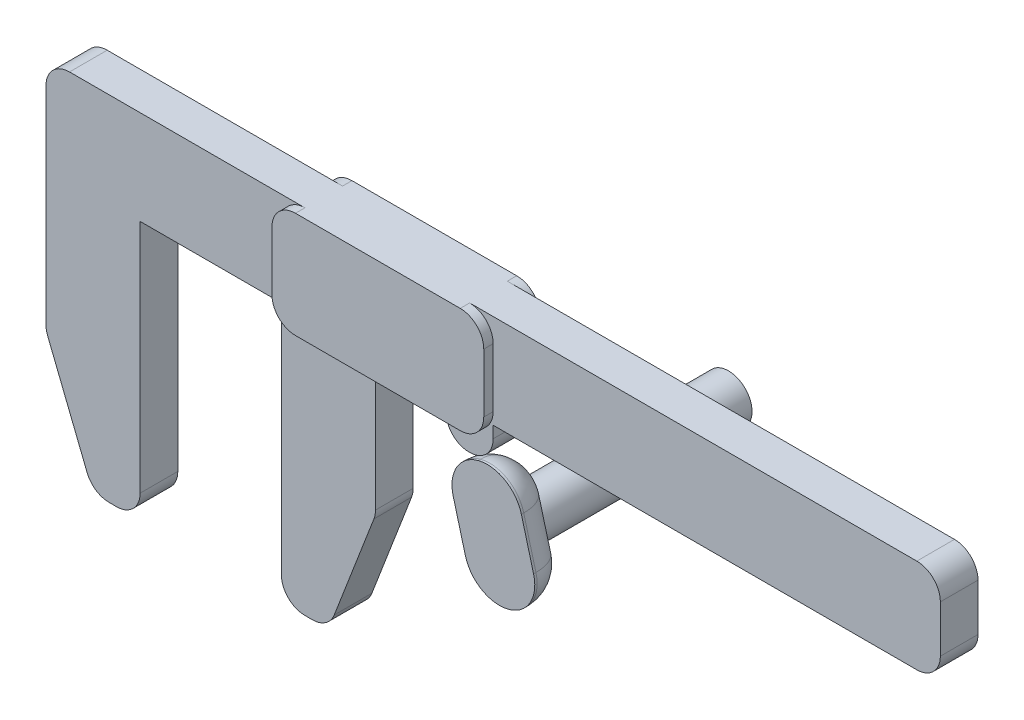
ISO-10303-21;
HEADER;
FILE_DESCRIPTION(('STEP AP214'),'2;1');
FILE_NAME('part.step','',(''),(''),'','','');
FILE_SCHEMA(('AUTOMOTIVE_DESIGN { 1 0 10303 214 1 1 1 1 }'));
ENDSEC;
DATA;
#1=APPLICATION_CONTEXT('core data for automotive mechanical design processes');
#2=APPLICATION_PROTOCOL_DEFINITION('international standard','automotive_design',2000,#1);
#3=PRODUCT_CONTEXT('',#1,'mechanical');
#4=PRODUCT('Part','Part','',(#3));
#5=PRODUCT_RELATED_PRODUCT_CATEGORY('part','',(#4));
#6=PRODUCT_DEFINITION_FORMATION('','',#4);
#7=PRODUCT_DEFINITION_CONTEXT('part definition',#1,'design');
#8=PRODUCT_DEFINITION('design','',#6,#7);
#9=PRODUCT_DEFINITION_SHAPE('','',#8);
#10=(LENGTH_UNIT() NAMED_UNIT(*) SI_UNIT(.MILLI.,.METRE.));
#11=(NAMED_UNIT(*) PLANE_ANGLE_UNIT() SI_UNIT($,.RADIAN.));
#12=(NAMED_UNIT(*) SI_UNIT($,.STERADIAN.) SOLID_ANGLE_UNIT());
#13=UNCERTAINTY_MEASURE_WITH_UNIT(LENGTH_MEASURE(1.E-05),#10,'distance_accuracy_value','');
#14=(GEOMETRIC_REPRESENTATION_CONTEXT(3) GLOBAL_UNCERTAINTY_ASSIGNED_CONTEXT((#13)) GLOBAL_UNIT_ASSIGNED_CONTEXT((#10,
#11,#12)) REPRESENTATION_CONTEXT('',''));
#15=CARTESIAN_POINT('',(0.,0.,0.));
#16=DIRECTION('',(0.,0.,1.));
#17=DIRECTION('',(1.,0.,0.));
#18=AXIS2_PLACEMENT_3D('',#15,#16,#17);
#19=CARTESIAN_POINT('',(0.,0.,-12.));
#20=DIRECTION('',(0.,0.,1.));
#21=DIRECTION('',(1.,0.,0.));
#22=AXIS2_PLACEMENT_3D('',#19,#20,#21);
#23=CYLINDRICAL_SURFACE('',#22,1.);
#24=CARTESIAN_POINT('',(-0.360896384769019,0.932605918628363,-1.59589092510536));
#25=CARTESIAN_POINT('',(-0.338415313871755,0.941307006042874,-1.59755942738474));
#26=CARTESIAN_POINT('',(-0.315592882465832,0.949201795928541,-1.59866745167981));
#27=CARTESIAN_POINT('',(-0.269415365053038,0.963326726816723,-1.59975773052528));
#28=CARTESIAN_POINT('',(-0.246060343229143,0.969557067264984,-1.59974012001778));
#29=CARTESIAN_POINT('',(-0.175623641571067,0.985628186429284,-1.59799722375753));
#30=CARTESIAN_POINT('',(-0.127966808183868,0.992927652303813,-1.59459681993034));
#31=CARTESIAN_POINT('',(-0.0326354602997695,1.00061364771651,-1.58340896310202));
#32=CARTESIAN_POINT('',(0.0150390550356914,1.00099799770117,-1.57562012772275));
#33=CARTESIAN_POINT('',(0.109121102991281,0.995144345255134,-1.55585120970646));
#34=CARTESIAN_POINT('',(0.155528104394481,0.988903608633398,-1.5438693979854));
#35=CARTESIAN_POINT('',(0.228493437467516,0.97396086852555,-1.5213674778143));
#36=CARTESIAN_POINT('',(0.25583224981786,0.967123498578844,-1.51205208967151));
#37=CARTESIAN_POINT('',(0.309297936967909,0.951372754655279,-1.49204080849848));
#38=CARTESIAN_POINT('',(0.335427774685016,0.942464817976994,-1.4813485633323));
#39=CARTESIAN_POINT('',(0.360896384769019,0.932605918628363,-1.46999024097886));
#40=B_SPLINE_CURVE_WITH_KNOTS('',3,(#24,#25,#26,#27,#28,#29,#30,#31,#32,#33,#34,#35,#36,#37,#38,
#39),.UNSPECIFIED.,.F.,.F.,(4,2,2,2,2,2,2,4),(0.,0.0724462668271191,0.144883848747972,
0.289111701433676,0.433385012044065,0.577717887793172,0.666641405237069,0.755333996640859),.UNSPECIFIED.);
#41=CARTESIAN_POINT('',(-0.258819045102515,0.96592582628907,-1.59960805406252));
#42=VERTEX_POINT('',#41);
#43=CARTESIAN_POINT('',(0.000825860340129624,0.999999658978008,-1.57736223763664));
#44=VERTEX_POINT('',#43);
#45=EDGE_CURVE('E176',#42,#44,#40,.T.);
#46=ORIENTED_EDGE('',*,*,#45,.T.);
#47=CARTESIAN_POINT('',(0.000825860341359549,0.99999965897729,-1.57736223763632));
#48=CARTESIAN_POINT('',(0.0288607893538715,0.999977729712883,-1.57260756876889));
#49=CARTESIAN_POINT('',(0.0567525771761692,0.998774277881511,-1.56715728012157));
#50=CARTESIAN_POINT('',(0.11204517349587,0.994089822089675,-1.55503024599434));
#51=CARTESIAN_POINT('',(0.139446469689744,0.990611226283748,-1.54835480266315));
#52=CARTESIAN_POINT('',(0.220283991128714,0.976956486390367,-1.52682981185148));
#53=CARTESIAN_POINT('',(0.272785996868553,0.963558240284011,-1.51040424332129));
#54=CARTESIAN_POINT('',(0.373880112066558,0.929012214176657,-1.47490871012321));
#55=CARTESIAN_POINT('',(0.42248686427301,0.907895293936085,-1.45584946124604));
#56=CARTESIAN_POINT('',(0.515563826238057,0.858474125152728,-1.41651450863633));
#57=CARTESIAN_POINT('',(0.56002067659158,0.830147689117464,-1.39623519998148));
#58=CARTESIAN_POINT('',(0.649137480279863,0.762955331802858,-1.3538093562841));
#59=CARTESIAN_POINT('',(0.693188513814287,0.723235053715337,-1.33172880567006));
#60=CARTESIAN_POINT('',(0.774245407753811,0.635675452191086,-1.29110602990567));
#61=CARTESIAN_POINT('',(0.811268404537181,0.587856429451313,-1.27255519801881));
#62=CARTESIAN_POINT('',(0.867132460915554,0.499937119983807,-1.24683682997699));
#63=CARTESIAN_POINT('',(0.888116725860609,0.461713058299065,-1.23792578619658));
#64=CARTESIAN_POINT('',(0.925113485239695,0.382204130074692,-1.22473218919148));
#65=CARTESIAN_POINT('',(0.941133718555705,0.340924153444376,-1.22044240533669));
#66=CARTESIAN_POINT('',(0.967630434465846,0.256252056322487,-1.2171581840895));
#67=CARTESIAN_POINT('',(0.978087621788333,0.212853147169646,-1.21818204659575));
#68=CARTESIAN_POINT('',(0.993091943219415,0.125453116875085,-1.22539446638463));
#69=CARTESIAN_POINT('',(0.997633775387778,0.0814514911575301,-1.23158764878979));
#70=CARTESIAN_POINT('',(1.00088394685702,-0.00445263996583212,-1.24791680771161));
#71=CARTESIAN_POINT('',(0.999782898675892,-0.0463760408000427,-1.25791352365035));
#72=CARTESIAN_POINT('',(0.992515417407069,-0.128973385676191,-1.28072955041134));
#73=CARTESIAN_POINT('',(0.986347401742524,-0.169646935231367,-1.29354974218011));
#74=CARTESIAN_POINT('',(0.967464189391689,-0.257780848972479,-1.32382023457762));
#75=CARTESIAN_POINT('',(0.953642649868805,-0.304863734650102,-1.34167682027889));
#76=CARTESIAN_POINT('',(0.919440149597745,-0.396250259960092,-1.37829850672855));
#77=CARTESIAN_POINT('',(0.899050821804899,-0.440550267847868,-1.39706474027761));
#78=CARTESIAN_POINT('',(0.847018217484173,-0.534819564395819,-1.43795679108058));
#79=CARTESIAN_POINT('',(0.813914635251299,-0.584044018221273,-1.45996690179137));
#80=CARTESIAN_POINT('',(0.738767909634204,-0.676581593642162,-1.50099171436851));
#81=CARTESIAN_POINT('',(0.696732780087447,-0.719899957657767,-1.52000907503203));
#82=CARTESIAN_POINT('',(0.61381507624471,-0.790933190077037,-1.54961711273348));
#83=CARTESIAN_POINT('',(0.574444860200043,-0.820028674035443,-1.56113532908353));
#84=CARTESIAN_POINT('',(0.491174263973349,-0.872441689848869,-1.58002179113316));
#85=CARTESIAN_POINT('',(0.447283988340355,-0.895771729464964,-1.58739906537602));
#86=CARTESIAN_POINT('',(0.378650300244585,-0.925884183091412,-1.59490011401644));
#87=CARTESIAN_POINT('',(0.355154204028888,-0.935149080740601,-1.59680680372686));
#88=CARTESIAN_POINT('',(0.307466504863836,-0.951894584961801,-1.59935831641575));
#89=CARTESIAN_POINT('',(0.283274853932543,-0.959375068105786,-1.60000305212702));
#90=CARTESIAN_POINT('',(0.258819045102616,-0.965925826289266,-1.60000000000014));
#91=B_SPLINE_CURVE_WITH_KNOTS('',3,(#47,#48,#49,#50,#51,#52,#53,#54,#55,#56,#57,#58,#59,#60,#61,
#62,#63,#64,#65,#66,#67,#68,#69,#70,#71,#72,#73,#74,#75,#76,#77,#78,#79,#80,#81,#82,#83,#84,#85,
#86,#87,#88,#89,#90),.UNSPECIFIED.,.F.,.F.,(4,2,2,2,2,2,2,2,2,2,2,2,2,2,2,2,2,2,2,2,2,4),(0.,
0.0852314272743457,0.170372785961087,0.339357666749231,0.5076741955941,0.676515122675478,
0.865505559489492,1.0540290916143,1.18701366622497,1.31978986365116,1.45302363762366,
1.58637674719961,1.71525559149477,1.84417470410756,2.00027920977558,2.15658337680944,
2.3454898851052,2.53422760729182,2.68448471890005,2.83441293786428,2.91030721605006,
2.98620674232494),.UNSPECIFIED.);
#92=CARTESIAN_POINT('',(0.258819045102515,-0.965925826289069,-1.6));
#93=VERTEX_POINT('',#92);
#94=EDGE_CURVE('E128',#44,#93,#91,.T.);
#95=ORIENTED_EDGE('',*,*,#94,.T.);
#96=CARTESIAN_POINT('',(0.258819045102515,-0.965925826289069,-1.6));
#97=CARTESIAN_POINT('',(0.234456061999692,-0.972456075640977,-1.6000030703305));
#98=CARTESIAN_POINT('',(0.209858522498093,-0.978056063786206,-1.5993631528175));
#99=CARTESIAN_POINT('',(0.160387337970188,-0.987374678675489,-1.59683120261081));
#100=CARTESIAN_POINT('',(0.135513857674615,-0.991094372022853,-1.59493988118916));
#101=CARTESIAN_POINT('',(0.061074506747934,-0.999372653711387,-1.58747331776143));
#102=CARTESIAN_POINT('',(0.0113449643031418,-1.00114182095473,-1.58010446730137));
#103=CARTESIAN_POINT('',(-0.0868943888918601,-0.997430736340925,-1.56125784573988));
#104=CARTESIAN_POINT('',(-0.135406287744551,-0.991963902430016,-1.54978770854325));
#105=CARTESIAN_POINT('',(-0.230336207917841,-0.97430984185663,-1.52364747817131));
#106=CARTESIAN_POINT('',(-0.276751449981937,-0.962113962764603,-1.50897327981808));
#107=CARTESIAN_POINT('',(-0.370501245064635,-0.930260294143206,-1.47613555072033));
#108=CARTESIAN_POINT('',(-0.417583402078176,-0.910060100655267,-1.45778214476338));
#109=CARTESIAN_POINT('',(-0.507819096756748,-0.86296844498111,-1.4199090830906));
#110=CARTESIAN_POINT('',(-0.550967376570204,-0.836068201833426,-1.40038792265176));
#111=CARTESIAN_POINT('',(-0.639290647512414,-0.771212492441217,-1.35864115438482));
#112=CARTESIAN_POINT('',(-0.683710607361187,-0.732182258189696,-1.33647500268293));
#113=CARTESIAN_POINT('',(-0.765645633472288,-0.645992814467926,-1.29542044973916));
#114=CARTESIAN_POINT('',(-0.803172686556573,-0.598847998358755,-1.27652636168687));
#115=CARTESIAN_POINT('',(-0.860237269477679,-0.511727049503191,-1.24988139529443));
#116=CARTESIAN_POINT('',(-0.881840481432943,-0.47361127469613,-1.24048824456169));
#117=CARTESIAN_POINT('',(-0.920079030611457,-0.394194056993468,-1.22628990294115));
#118=CARTESIAN_POINT('',(-0.936722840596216,-0.352898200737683,-1.22147685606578));
#119=CARTESIAN_POINT('',(-0.964452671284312,-0.268013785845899,-1.21718303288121));
#120=CARTESIAN_POINT('',(-0.975515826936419,-0.224416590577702,-1.21772400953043));
#121=CARTESIAN_POINT('',(-0.991650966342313,-0.136491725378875,-1.22409884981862));
#122=CARTESIAN_POINT('',(-0.996717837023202,-0.0921634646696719,-1.22993722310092));
#123=CARTESIAN_POINT('',(-1.00087181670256,-0.00601498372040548,-1.24563614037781));
#124=CARTESIAN_POINT('',(-1.00021275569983,0.0358296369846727,-1.2553079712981));
#125=CARTESIAN_POINT('',(-0.99383775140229,0.118321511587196,-1.27754881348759));
#126=CARTESIAN_POINT('',(-0.98812042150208,0.158968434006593,-1.29011861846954));
#127=CARTESIAN_POINT('',(-0.970306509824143,0.246781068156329,-1.31981849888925));
#128=CARTESIAN_POINT('',(-0.957149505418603,0.293592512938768,-1.33735618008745));
#129=CARTESIAN_POINT('',(-0.924376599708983,0.384536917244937,-1.37345212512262));
#130=CARTESIAN_POINT('',(-0.904750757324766,0.428665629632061,-1.39201192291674));
#131=CARTESIAN_POINT('',(-0.854349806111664,0.523003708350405,-1.43273412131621));
#132=CARTESIAN_POINT('',(-0.822081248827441,0.572463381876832,-1.45480731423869));
#133=CARTESIAN_POINT('',(-0.748686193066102,0.665555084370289,-1.49612288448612));
#134=CARTESIAN_POINT('',(-0.707582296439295,0.709201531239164,-1.5153722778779));
#135=CARTESIAN_POINT('',(-0.637762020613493,0.770934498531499,-1.54134663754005));
#136=CARTESIAN_POINT('',(-0.611932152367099,0.791607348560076,-1.54978245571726));
#137=CARTESIAN_POINT('',(-0.557988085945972,0.830516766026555,-1.56493677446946));
#138=CARTESIAN_POINT('',(-0.529871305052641,0.848750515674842,-1.5716532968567));
#139=CARTESIAN_POINT('',(-0.500715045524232,0.865612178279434,-1.57736223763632));
#140=B_SPLINE_CURVE_WITH_KNOTS('',3,(#96,#97,#98,#99,#100,#101,#102,#103,#104,#105,#106,#107,
#108,#109,#110,#111,#112,#113,#114,#115,#116,#117,#118,#119,#120,#121,#122,#123,#124,#125,#126,
#127,#128,#129,#130,#131,#132,#133,#134,#135,#136,#137,#138,#139),.UNSPECIFIED.,.F.,.F.,(4,2,2,
2,2,2,2,2,2,2,2,2,2,2,2,2,2,2,2,2,2,4),(0.,0.0756155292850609,0.151188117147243,
0.301278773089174,0.451091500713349,0.601097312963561,0.763749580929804,0.926616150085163,
1.115188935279,1.30343062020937,1.43732181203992,1.57098293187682,1.7051873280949,
1.839506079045,1.96790194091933,2.09633301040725,2.25086851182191,2.4056426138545,
2.59389847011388,2.78167835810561,2.88391867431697,2.98627610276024),.UNSPECIFIED.);
#141=CARTESIAN_POINT('',(-0.50071504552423,0.865612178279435,-1.57736223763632));
#142=VERTEX_POINT('',#141);
#143=EDGE_CURVE('E125',#93,#142,#140,.T.);
#144=ORIENTED_EDGE('',*,*,#143,.T.);
#145=CARTESIAN_POINT('',(-0.838840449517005,0.544377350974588,-1.42375410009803));
#146=CARTESIAN_POINT('',(-0.826026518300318,0.564122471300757,-1.43524799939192));
#147=CARTESIAN_POINT('',(-0.812389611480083,0.583607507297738,-1.44625431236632));
#148=CARTESIAN_POINT('',(-0.783462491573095,0.621903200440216,-1.46725481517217));
#149=CARTESIAN_POINT('',(-0.768171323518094,0.640713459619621,-1.47724841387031));
#150=CARTESIAN_POINT('',(-0.719726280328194,0.695983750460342,-1.50569583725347));
#151=CARTESIAN_POINT('',(-0.684082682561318,0.731155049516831,-1.52254230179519));
#152=CARTESIAN_POINT('',(-0.606633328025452,0.796605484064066,-1.55155747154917));
#153=CARTESIAN_POINT('',(-0.564804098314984,0.826865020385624,-1.56370769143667));
#154=CARTESIAN_POINT('',(-0.476200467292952,0.88085556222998,-1.58286058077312));
#155=CARTESIAN_POINT('',(-0.429444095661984,0.90460929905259,-1.58988131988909));
#156=CARTESIAN_POINT('',(-0.359678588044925,0.933362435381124,-1.59616007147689));
#157=CARTESIAN_POINT('',(-0.338059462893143,0.941408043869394,-1.59756341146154));
#158=CARTESIAN_POINT('',(-0.294278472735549,0.955997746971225,-1.59934273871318));
#159=CARTESIAN_POINT('',(-0.272116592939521,0.962541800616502,-1.59971869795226));
#160=CARTESIAN_POINT('',(-0.249744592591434,0.968311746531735,-1.59957970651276));
#161=B_SPLINE_CURVE_WITH_KNOTS('',3,(#145,#146,#147,#148,#149,#150,#151,#152,#153,#154,#155,
#156,#157,#158,#159,#160),.UNSPECIFIED.,.F.,.F.,(4,2,2,2,2,2,2,4),(0.,0.0785481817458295,
0.157141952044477,0.31483118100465,0.473134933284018,0.630878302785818,0.700144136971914,
0.769411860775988),.UNSPECIFIED.);
#162=EDGE_CURVE('E115',#142,#42,#161,.T.);
#163=ORIENTED_EDGE('',*,*,#162,.T.);
#164=EDGE_LOOP('',(#46,#95,#144,#163));
#165=FACE_BOUND('',#164,.T.);
#166=CARTESIAN_POINT('',(0.,0.,-10.));
#167=DIRECTION('',(0.,0.,1.));
#168=DIRECTION('',(1.,0.,0.));
#169=AXIS2_PLACEMENT_3D('',#166,#167,#168);
#170=CIRCLE('',#169,1.);
#171=CARTESIAN_POINT('',(1.,0.,-10.));
#172=VERTEX_POINT('',#171);
#173=EDGE_CURVE('E51',#172,#172,#170,.T.);
#174=ORIENTED_EDGE('',*,*,#173,.T.);
#175=EDGE_LOOP('',(#174));
#176=FACE_BOUND('',#175,.T.);
#177=ADVANCED_FACE('F47',(#165,#176),#23,.T.);
#178=CARTESIAN_POINT('',(2.10481080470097,-2.05970590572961,-1.6));
#179=DIRECTION('',(0.96592582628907,0.258819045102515,0.));
#180=DIRECTION('',(-0.258819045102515,0.96592582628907,0.));
#181=AXIS2_PLACEMENT_3D('',#178,#179,#180);
#182=PLANE('',#181);
#183=DIRECTION('',(-0.258819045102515,0.96592582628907,0.));
#184=VECTOR('',#183,1.);
#185=CARTESIAN_POINT('',(2.10481080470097,-2.05970590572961,-0.100000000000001));
#186=LINE('',#185,#184);
#187=CARTESIAN_POINT('',(1.19894414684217,1.32103448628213,-0.100000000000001));
#188=VERTEX_POINT('',#187);
#189=CARTESIAN_POINT('',(1.7165822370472,-0.610817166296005,-0.100000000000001));
#190=VERTEX_POINT('',#189);
#191=EDGE_CURVE('E210',#188,#190,#186,.F.);
#192=ORIENTED_EDGE('',*,*,#191,.F.);
#193=DIRECTION('',(0.,0.,1.));
#194=VECTOR('',#193,1.);
#195=CARTESIAN_POINT('',(1.19894414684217,1.32103448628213,-1.6));
#196=LINE('',#195,#194);
#197=CARTESIAN_POINT('',(1.19894414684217,1.32103448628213,0.));
#198=VERTEX_POINT('',#197);
#199=EDGE_CURVE('E212',#198,#188,#196,.F.);
#200=ORIENTED_EDGE('',*,*,#199,.F.);
#201=DIRECTION('',(-0.258819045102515,0.96592582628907,0.));
#202=VECTOR('',#201,1.);
#203=CARTESIAN_POINT('',(2.10481080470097,-2.05970590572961,0.));
#204=LINE('',#203,#202);
#205=CARTESIAN_POINT('',(1.7165822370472,-0.610817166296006,0.));
#206=VERTEX_POINT('',#205);
#207=EDGE_CURVE('E12',#206,#198,#204,.T.);
#208=ORIENTED_EDGE('',*,*,#207,.F.);
#209=DIRECTION('',(0.,0.,1.));
#210=VECTOR('',#209,1.);
#211=CARTESIAN_POINT('',(1.7165822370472,-0.610817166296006,-1.6));
#212=LINE('',#211,#210);
#213=EDGE_CURVE('E154',#190,#206,#212,.T.);
#214=ORIENTED_EDGE('',*,*,#213,.F.);
#215=EDGE_LOOP('',(#192,#200,#208,#214));
#216=FACE_BOUND('',#215,.T.);
#217=ADVANCED_FACE('F168',(#216),#182,.T.);
#218=CARTESIAN_POINT('',(-0.792966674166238,-2.83616304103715,-1.6));
#219=DIRECTION('',(0.96592582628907,0.258819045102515,0.));
#220=DIRECTION('',(-0.258819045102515,0.96592582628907,0.));
#221=AXIS2_PLACEMENT_3D('',#218,#219,#220);
#222=PLANE('',#221);
#223=DIRECTION('',(-0.258819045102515,0.96592582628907,0.));
#224=VECTOR('',#223,1.);
#225=CARTESIAN_POINT('',(-0.792966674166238,-2.83616304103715,0.));
#226=LINE('',#225,#224);
#227=CARTESIAN_POINT('',(-1.18119524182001,-1.38727430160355,0.));
#228=VERTEX_POINT('',#227);
#229=CARTESIAN_POINT('',(-1.69883333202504,0.544577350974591,0.));
#230=VERTEX_POINT('',#229);
#231=EDGE_CURVE('E217',#228,#230,#226,.T.);
#232=ORIENTED_EDGE('',*,*,#231,.T.);
#233=DIRECTION('',(0.,0.,1.));
#234=VECTOR('',#233,1.);
#235=CARTESIAN_POINT('',(-1.69883333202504,0.544577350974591,0.));
#236=LINE('',#235,#234);
#237=CARTESIAN_POINT('',(-1.69883333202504,0.54457735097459,-0.100000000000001));
#238=VERTEX_POINT('',#237);
#239=EDGE_CURVE('E140',#238,#230,#236,.T.);
#240=ORIENTED_EDGE('',*,*,#239,.F.);
#241=DIRECTION('',(-0.258819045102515,0.96592582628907,0.));
#242=VECTOR('',#241,1.);
#243=CARTESIAN_POINT('',(-0.792966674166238,-2.83616304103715,-0.100000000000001));
#244=LINE('',#243,#242);
#245=CARTESIAN_POINT('',(-1.18119524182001,-1.38727430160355,-0.100000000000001));
#246=VERTEX_POINT('',#245);
#247=EDGE_CURVE('E136',#246,#238,#244,.T.);
#248=ORIENTED_EDGE('',*,*,#247,.F.);
#249=DIRECTION('',(0.,0.,1.));
#250=VECTOR('',#249,1.);
#251=CARTESIAN_POINT('',(-1.18119524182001,-1.38727430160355,-0.0999999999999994));
#252=LINE('',#251,#250);
#253=EDGE_CURVE('E150',#228,#246,#252,.F.);
#254=ORIENTED_EDGE('',*,*,#253,.F.);
#255=EDGE_LOOP('',(#232,#240,#248,#254));
#256=FACE_BOUND('',#255,.T.);
#257=ADVANCED_FACE('F198',(#256),#222,.F.);
#258=CARTESIAN_POINT('',(-0.638173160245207,2.38169465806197,-0.100000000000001));
#259=DIRECTION('',(0.258819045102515,-0.96592582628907,0.));
#260=DIRECTION('',(0.96592582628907,0.258819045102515,0.));
#261=AXIS2_PLACEMENT_3D('',#258,#259,#260);
#262=CYLINDRICAL_SURFACE('',#261,1.5);
#263=CARTESIAN_POINT('',(-0.249944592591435,0.932805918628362,-0.100000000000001));
#264=DIRECTION('',(0.258819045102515,-0.96592582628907,0.));
#265=DIRECTION('',(0.96592582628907,0.258819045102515,0.));
#266=AXIS2_PLACEMENT_3D('',#263,#264,#265);
#267=CIRCLE('',#266,1.5);
#268=EDGE_CURVE('E220',#188,#44,#267,.F.);
#269=ORIENTED_EDGE('',*,*,#268,.F.);
#270=ORIENTED_EDGE('',*,*,#191,.T.);
#271=CARTESIAN_POINT('',(0.267693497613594,-0.999045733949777,-0.100000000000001));
#272=DIRECTION('',(0.258819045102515,-0.96592582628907,0.));
#273=DIRECTION('',(0.96592582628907,0.258819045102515,0.));
#274=AXIS2_PLACEMENT_3D('',#271,#272,#273);
#275=CIRCLE('',#274,1.5);
#276=CARTESIAN_POINT('',(0.267693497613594,-0.999045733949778,-1.6));
#277=VERTEX_POINT('',#276);
#278=EDGE_CURVE('E146',#277,#190,#275,.T.);
#279=ORIENTED_EDGE('',*,*,#278,.F.);
#280=DIRECTION('',(-0.258819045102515,0.96592582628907,0.));
#281=VECTOR('',#280,1.);
#282=CARTESIAN_POINT('',(-0.638173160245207,2.38169465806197,-1.6));
#283=LINE('',#282,#281);
#284=EDGE_CURVE('E216',#277,#93,#283,.T.);
#285=ORIENTED_EDGE('',*,*,#284,.T.);
#286=ORIENTED_EDGE('',*,*,#94,.F.);
#287=EDGE_LOOP('',(#269,#270,#279,#285,#286));
#288=FACE_BOUND('',#287,.T.);
#289=ADVANCED_FACE('F193',(#288),#262,.T.);
#290=CARTESIAN_POINT('',(0.655922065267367,-2.44793447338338,-0.100000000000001));
#291=DIRECTION('',(-0.258819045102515,0.96592582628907,0.));
#292=DIRECTION('',(-0.96592582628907,-0.258819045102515,0.));
#293=AXIS2_PLACEMENT_3D('',#290,#291,#292);
#294=CYLINDRICAL_SURFACE('',#293,1.5);
#295=ORIENTED_EDGE('',*,*,#284,.F.);
#296=CARTESIAN_POINT('',(0.267693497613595,-0.999045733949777,-0.100000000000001));
#297=DIRECTION('',(-0.258819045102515,0.96592582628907,0.));
#298=DIRECTION('',(-0.96592582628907,-0.258819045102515,0.));
#299=AXIS2_PLACEMENT_3D('',#296,#297,#298);
#300=CIRCLE('',#299,1.5);
#301=EDGE_CURVE('E148',#246,#277,#300,.F.);
#302=ORIENTED_EDGE('',*,*,#301,.F.);
#303=ORIENTED_EDGE('',*,*,#247,.T.);
#304=CARTESIAN_POINT('',(-0.249944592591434,0.932805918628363,-0.100000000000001));
#305=DIRECTION('',(-0.258819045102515,0.96592582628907,0.));
#306=DIRECTION('',(-0.96592582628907,-0.258819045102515,0.));
#307=AXIS2_PLACEMENT_3D('',#304,#305,#306);
#308=CIRCLE('',#307,1.5);
#309=EDGE_CURVE('E120',#142,#238,#308,.T.);
#310=ORIENTED_EDGE('',*,*,#309,.F.);
#311=ORIENTED_EDGE('',*,*,#143,.F.);
#312=EDGE_LOOP('',(#295,#302,#303,#310,#311));
#313=FACE_BOUND('',#312,.T.);
#314=ADVANCED_FACE('F133',(#313),#294,.T.);
#315=CARTESIAN_POINT('',(0.267693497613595,-0.999045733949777,-0.100000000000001));
#316=DIRECTION('',(0.,0.,1.));
#317=DIRECTION('',(1.,0.,0.));
#318=AXIS2_PLACEMENT_3D('',#315,#316,#317);
#319=SPHERICAL_SURFACE('',#318,1.5);
#320=CARTESIAN_POINT('',(0.267693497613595,-0.999045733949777,-0.100000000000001));
#321=DIRECTION('',(-0.96592582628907,-0.258819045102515,0.));
#322=DIRECTION('',(0.258819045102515,-0.96592582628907,0.));
#323=AXIS2_PLACEMENT_3D('',#320,#321,#322);
#324=CIRCLE('',#323,1.5);
#325=CARTESIAN_POINT('',(0.655922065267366,-2.44793447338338,-0.100000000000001));
#326=VERTEX_POINT('',#325);
#327=EDGE_CURVE('E239',#277,#326,#324,.T.);
#328=ORIENTED_EDGE('',*,*,#327,.T.);
#329=CARTESIAN_POINT('',(0.267693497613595,-0.999045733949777,-0.100000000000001));
#330=DIRECTION('',(0.,0.,-1.));
#331=DIRECTION('',(-1.,0.,0.));
#332=AXIS2_PLACEMENT_3D('',#329,#330,#331);
#333=CIRCLE('',#332,1.5);
#334=EDGE_CURVE('E151',#326,#246,#333,.T.);
#335=ORIENTED_EDGE('',*,*,#334,.T.);
#336=ORIENTED_EDGE('',*,*,#301,.T.);
#337=EDGE_LOOP('',(#328,#335,#336));
#338=FACE_BOUND('',#337,.T.);
#339=ADVANCED_FACE('F192',(#338),#319,.T.);
#340=CARTESIAN_POINT('',(0.267693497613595,-0.999045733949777,-1.6));
#341=DIRECTION('',(0.,0.,-1.));
#342=DIRECTION('',(-1.,0.,0.));
#343=AXIS2_PLACEMENT_3D('',#340,#341,#342);
#344=CYLINDRICAL_SURFACE('',#343,1.5);
#345=ORIENTED_EDGE('',*,*,#253,.T.);
#346=ORIENTED_EDGE('',*,*,#334,.F.);
#347=DIRECTION('',(0.,0.,1.));
#348=VECTOR('',#347,1.);
#349=CARTESIAN_POINT('',(0.655922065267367,-2.44793447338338,0.));
#350=LINE('',#349,#348);
#351=CARTESIAN_POINT('',(0.655922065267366,-2.44793447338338,0.));
#352=VERTEX_POINT('',#351);
#353=EDGE_CURVE('E156',#326,#352,#350,.T.);
#354=ORIENTED_EDGE('',*,*,#353,.T.);
#355=CARTESIAN_POINT('',(0.267693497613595,-0.999045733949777,0.));
#356=DIRECTION('',(0.,0.,-1.));
#357=DIRECTION('',(-1.,0.,0.));
#358=AXIS2_PLACEMENT_3D('',#355,#356,#357);
#359=CIRCLE('',#358,1.5);
#360=EDGE_CURVE('E66',#352,#228,#359,.T.);
#361=ORIENTED_EDGE('',*,*,#360,.T.);
#362=EDGE_LOOP('',(#345,#346,#354,#361));
#363=FACE_BOUND('',#362,.T.);
#364=ADVANCED_FACE('F254',(#363),#344,.T.);
#365=CARTESIAN_POINT('',(0.267693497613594,-0.999045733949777,-0.100000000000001));
#366=DIRECTION('',(0.,0.,1.));
#367=DIRECTION('',(1.,0.,0.));
#368=AXIS2_PLACEMENT_3D('',#365,#366,#367);
#369=SPHERICAL_SURFACE('',#368,1.5);
#370=ORIENTED_EDGE('',*,*,#278,.T.);
#371=CARTESIAN_POINT('',(0.267693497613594,-0.999045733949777,-0.100000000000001));
#372=DIRECTION('',(0.,0.,-1.));
#373=DIRECTION('',(-1.,0.,0.));
#374=AXIS2_PLACEMENT_3D('',#371,#372,#373);
#375=CIRCLE('',#374,1.5);
#376=EDGE_CURVE('E234',#190,#326,#375,.T.);
#377=ORIENTED_EDGE('',*,*,#376,.T.);
#378=ORIENTED_EDGE('',*,*,#327,.F.);
#379=EDGE_LOOP('',(#370,#377,#378));
#380=FACE_BOUND('',#379,.T.);
#381=ADVANCED_FACE('F262',(#380),#369,.T.);
#382=CARTESIAN_POINT('',(0.267693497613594,-0.999045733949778,-1.6));
#383=DIRECTION('',(0.,0.,1.));
#384=DIRECTION('',(1.,0.,0.));
#385=AXIS2_PLACEMENT_3D('',#382,#383,#384);
#386=CYLINDRICAL_SURFACE('',#385,1.5);
#387=ORIENTED_EDGE('',*,*,#376,.F.);
#388=ORIENTED_EDGE('',*,*,#213,.T.);
#389=CARTESIAN_POINT('',(0.267693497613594,-0.999045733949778,0.));
#390=DIRECTION('',(0.,0.,-1.));
#391=DIRECTION('',(-1.,0.,0.));
#392=AXIS2_PLACEMENT_3D('',#389,#390,#391);
#393=CIRCLE('',#392,1.5);
#394=EDGE_CURVE('E152',#206,#352,#393,.T.);
#395=ORIENTED_EDGE('',*,*,#394,.T.);
#396=ORIENTED_EDGE('',*,*,#353,.F.);
#397=EDGE_LOOP('',(#387,#388,#395,#396));
#398=FACE_BOUND('',#397,.T.);
#399=ADVANCED_FACE('F261',(#398),#386,.T.);
#400=CARTESIAN_POINT('',(-0.249944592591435,0.932805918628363,-0.100000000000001));
#401=DIRECTION('',(0.,0.,1.));
#402=DIRECTION('',(1.,0.,0.));
#403=AXIS2_PLACEMENT_3D('',#400,#401,#402);
#404=SPHERICAL_SURFACE('',#403,1.5);
#405=CARTESIAN_POINT('',(-0.249944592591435,0.932805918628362,-0.100000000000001));
#406=DIRECTION('',(0.96592582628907,0.258819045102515,0.));
#407=DIRECTION('',(-0.258819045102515,0.96592582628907,0.));
#408=AXIS2_PLACEMENT_3D('',#405,#406,#407);
#409=CIRCLE('',#408,1.5);
#410=CARTESIAN_POINT('',(-0.638173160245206,2.38169465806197,-0.100000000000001));
#411=VERTEX_POINT('',#410);
#412=EDGE_CURVE('E122',#42,#411,#409,.T.);
#413=ORIENTED_EDGE('',*,*,#412,.T.);
#414=CARTESIAN_POINT('',(-0.249944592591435,0.932805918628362,-0.100000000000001));
#415=DIRECTION('',(0.,0.,-1.));
#416=DIRECTION('',(-1.,0.,0.));
#417=AXIS2_PLACEMENT_3D('',#414,#415,#416);
#418=CIRCLE('',#417,1.5);
#419=EDGE_CURVE('E224',#411,#188,#418,.T.);
#420=ORIENTED_EDGE('',*,*,#419,.T.);
#421=ORIENTED_EDGE('',*,*,#268,.T.);
#422=ORIENTED_EDGE('',*,*,#45,.F.);
#423=EDGE_LOOP('',(#413,#420,#421,#422));
#424=FACE_BOUND('',#423,.T.);
#425=ADVANCED_FACE('F226',(#424),#404,.T.);
#426=CARTESIAN_POINT('',(-0.249944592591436,0.932805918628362,-1.6));
#427=DIRECTION('',(0.,0.,1.));
#428=DIRECTION('',(1.,0.,0.));
#429=AXIS2_PLACEMENT_3D('',#426,#427,#428);
#430=CYLINDRICAL_SURFACE('',#429,1.5);
#431=ORIENTED_EDGE('',*,*,#199,.T.);
#432=ORIENTED_EDGE('',*,*,#419,.F.);
#433=DIRECTION('',(0.,0.,1.));
#434=VECTOR('',#433,1.);
#435=CARTESIAN_POINT('',(-0.638173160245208,2.38169465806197,-1.6));
#436=LINE('',#435,#434);
#437=CARTESIAN_POINT('',(-0.638173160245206,2.38169465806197,0.));
#438=VERTEX_POINT('',#437);
#439=EDGE_CURVE('E142',#411,#438,#436,.T.);
#440=ORIENTED_EDGE('',*,*,#439,.T.);
#441=CARTESIAN_POINT('',(-0.249944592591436,0.932805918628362,0.));
#442=DIRECTION('',(0.,0.,-1.));
#443=DIRECTION('',(-1.,0.,0.));
#444=AXIS2_PLACEMENT_3D('',#441,#442,#443);
#445=CIRCLE('',#444,1.5);
#446=EDGE_CURVE('E81',#438,#198,#445,.T.);
#447=ORIENTED_EDGE('',*,*,#446,.T.);
#448=EDGE_LOOP('',(#431,#432,#440,#447));
#449=FACE_BOUND('',#448,.T.);
#450=ADVANCED_FACE('F272',(#449),#430,.T.);
#451=CARTESIAN_POINT('',(-0.249944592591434,0.932805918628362,-0.100000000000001));
#452=DIRECTION('',(0.,0.,1.));
#453=DIRECTION('',(1.,0.,0.));
#454=AXIS2_PLACEMENT_3D('',#451,#452,#453);
#455=SPHERICAL_SURFACE('',#454,1.5);
#456=ORIENTED_EDGE('',*,*,#309,.T.);
#457=CARTESIAN_POINT('',(-0.249944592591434,0.932805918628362,-0.100000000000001));
#458=DIRECTION('',(0.,0.,-1.));
#459=DIRECTION('',(-1.,0.,0.));
#460=AXIS2_PLACEMENT_3D('',#457,#458,#459);
#461=CIRCLE('',#460,1.5);
#462=EDGE_CURVE('E138',#238,#411,#461,.T.);
#463=ORIENTED_EDGE('',*,*,#462,.T.);
#464=ORIENTED_EDGE('',*,*,#412,.F.);
#465=ORIENTED_EDGE('',*,*,#162,.F.);
#466=EDGE_LOOP('',(#456,#463,#464,#465));
#467=FACE_BOUND('',#466,.T.);
#468=ADVANCED_FACE('F117',(#467),#455,.T.);
#469=CARTESIAN_POINT('',(-0.249944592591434,0.932805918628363,-1.6));
#470=DIRECTION('',(0.,0.,-1.));
#471=DIRECTION('',(-1.,0.,0.));
#472=AXIS2_PLACEMENT_3D('',#469,#470,#471);
#473=CYLINDRICAL_SURFACE('',#472,1.5);
#474=ORIENTED_EDGE('',*,*,#462,.F.);
#475=ORIENTED_EDGE('',*,*,#239,.T.);
#476=CARTESIAN_POINT('',(-0.249944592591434,0.932805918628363,0.));
#477=DIRECTION('',(0.,0.,-1.));
#478=DIRECTION('',(-1.,0.,0.));
#479=AXIS2_PLACEMENT_3D('',#476,#477,#478);
#480=CIRCLE('',#479,1.5);
#481=EDGE_CURVE('E57',#230,#438,#480,.T.);
#482=ORIENTED_EDGE('',*,*,#481,.T.);
#483=ORIENTED_EDGE('',*,*,#439,.F.);
#484=EDGE_LOOP('',(#474,#475,#482,#483));
#485=FACE_BOUND('',#484,.T.);
#486=ADVANCED_FACE('F170',(#485),#473,.T.);
#487=CARTESIAN_POINT('',(18.,12.,-10.));
#488=DIRECTION('',(0.,0.,1.));
#489=DIRECTION('',(1.,0.,0.));
#490=AXIS2_PLACEMENT_3D('',#487,#488,#489);
#491=PLANE('',#490);
#492=ORIENTED_EDGE('',*,*,#173,.F.);
#493=EDGE_LOOP('',(#492));
#494=FACE_BOUND('',#493,.T.);
#495=ADVANCED_FACE('F169',(#494),#491,.F.);
#496=CARTESIAN_POINT('',(-18.,12.,0.));
#497=DIRECTION('',(0.,0.,1.));
#498=DIRECTION('',(1.,0.,0.));
#499=AXIS2_PLACEMENT_3D('',#496,#497,#498);
#500=PLANE('',#499);
#501=ORIENTED_EDGE('',*,*,#394,.F.);
#502=ORIENTED_EDGE('',*,*,#207,.T.);
#503=ORIENTED_EDGE('',*,*,#446,.F.);
#504=ORIENTED_EDGE('',*,*,#481,.F.);
#505=ORIENTED_EDGE('',*,*,#231,.F.);
#506=ORIENTED_EDGE('',*,*,#360,.F.);
#507=EDGE_LOOP('',(#501,#502,#503,#504,#505,#506));
#508=FACE_BOUND('',#507,.T.);
#509=ADVANCED_FACE('F49',(#508),#500,.T.);
#510=CLOSED_SHELL('',(#177,#217,#257,#289,#314,#339,#364,#381,#399,#425,#450,#468,#486,#495,#509));
#511=MANIFOLD_SOLID_BREP('B2_NOT_SHOWN',#510);
#512=CARTESIAN_POINT('',(-19.,6.99999999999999,-1.6));
#513=DIRECTION('',(-1.,0.,0.));
#514=DIRECTION('',(0.,0.,1.));
#515=AXIS2_PLACEMENT_3D('',#512,#513,#514);
#516=PLANE('',#515);
#517=DIRECTION('',(0.,-1.,0.));
#518=VECTOR('',#517,1.);
#519=CARTESIAN_POINT('',(-19.,6.99999999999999,0.));
#520=LINE('',#519,#518);
#521=CARTESIAN_POINT('',(-19.,6.99999999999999,0.));
#522=VERTEX_POINT('',#521);
#523=CARTESIAN_POINT('',(-19.,-1.80741759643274,0.));
#524=VERTEX_POINT('',#523);
#525=EDGE_CURVE('E849',#522,#524,#520,.T.);
#526=ORIENTED_EDGE('',*,*,#525,.F.);
#527=DIRECTION('',(0.,0.,1.));
#528=VECTOR('',#527,1.);
#529=CARTESIAN_POINT('',(-19.,6.99999999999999,-1.6));
#530=LINE('',#529,#528);
#531=CARTESIAN_POINT('',(-19.,6.99999999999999,-1.6));
#532=VERTEX_POINT('',#531);
#533=EDGE_CURVE('E687',#532,#522,#530,.T.);
#534=ORIENTED_EDGE('',*,*,#533,.F.);
#535=DIRECTION('',(0.,-1.,0.));
#536=VECTOR('',#535,1.);
#537=CARTESIAN_POINT('',(-19.,6.99999999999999,-1.6));
#538=LINE('',#537,#536);
#539=CARTESIAN_POINT('',(-19.,-1.80741759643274,-1.6));
#540=VERTEX_POINT('',#539);
#541=EDGE_CURVE('E694',#532,#540,#538,.T.);
#542=ORIENTED_EDGE('',*,*,#541,.T.);
#543=DIRECTION('',(0.,0.,1.));
#544=VECTOR('',#543,1.);
#545=CARTESIAN_POINT('',(-19.,-1.80741759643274,-1.6));
#546=LINE('',#545,#544);
#547=EDGE_CURVE('E691',#540,#524,#546,.T.);
#548=ORIENTED_EDGE('',*,*,#547,.T.);
#549=EDGE_LOOP('',(#526,#534,#542,#548));
#550=FACE_BOUND('',#549,.T.);
#551=ADVANCED_FACE('F372',(#550),#516,.T.);
#552=CARTESIAN_POINT('',(-18.,-1.80741759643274,-1.6));
#553=DIRECTION('',(0.,0.,1.));
#554=DIRECTION('',(1.,0.,0.));
#555=AXIS2_PLACEMENT_3D('',#552,#553,#554);
#556=CYLINDRICAL_SURFACE('',#555,0.999999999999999);
#557=CARTESIAN_POINT('',(-18.,-1.80741759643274,0.));
#558=DIRECTION('',(0.,0.,1.));
#559=DIRECTION('',(1.,0.,0.));
#560=AXIS2_PLACEMENT_3D('',#557,#558,#559);
#561=CIRCLE('',#560,0.999999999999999);
#562=CARTESIAN_POINT('',(-18.9284766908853,-2.17880827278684,0.));
#563=VERTEX_POINT('',#562);
#564=EDGE_CURVE('E847',#524,#563,#561,.T.);
#565=ORIENTED_EDGE('',*,*,#564,.F.);
#566=ORIENTED_EDGE('',*,*,#547,.F.);
#567=CARTESIAN_POINT('',(-18.,-1.80741759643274,-1.6));
#568=DIRECTION('',(0.,0.,1.));
#569=DIRECTION('',(1.,0.,0.));
#570=AXIS2_PLACEMENT_3D('',#567,#568,#569);
#571=CIRCLE('',#570,0.999999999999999);
#572=CARTESIAN_POINT('',(-18.9284766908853,-2.17880827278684,-1.6));
#573=VERTEX_POINT('',#572);
#574=EDGE_CURVE('E698',#540,#573,#571,.T.);
#575=ORIENTED_EDGE('',*,*,#574,.T.);
#576=DIRECTION('',(0.,0.,1.));
#577=VECTOR('',#576,1.);
#578=CARTESIAN_POINT('',(-18.9284766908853,-2.17880827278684,-1.6));
#579=LINE('',#578,#577);
#580=EDGE_CURVE('E695',#573,#563,#579,.T.);
#581=ORIENTED_EDGE('',*,*,#580,.T.);
#582=EDGE_LOOP('',(#565,#566,#575,#581));
#583=FACE_BOUND('',#582,.T.);
#584=ADVANCED_FACE('F879',(#583),#556,.T.);
#585=CARTESIAN_POINT('',(-18.9284766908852,-2.17880827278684,-1.6));
#586=DIRECTION('',(-0.928476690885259,-0.371390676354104,0.));
#587=DIRECTION('',(0.371390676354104,-0.92847669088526,0.));
#588=AXIS2_PLACEMENT_3D('',#585,#586,#587);
#589=PLANE('',#588);
#590=DIRECTION('',(0.371390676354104,-0.928476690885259,0.));
#591=VECTOR('',#590,1.);
#592=CARTESIAN_POINT('',(-18.9284766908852,-2.17880827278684,0.));
#593=LINE('',#592,#591);
#594=CARTESIAN_POINT('',(-17.2514437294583,-6.3713906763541,0.));
#595=VERTEX_POINT('',#594);
#596=EDGE_CURVE('E844',#563,#595,#593,.T.);
#597=ORIENTED_EDGE('',*,*,#596,.F.);
#598=ORIENTED_EDGE('',*,*,#580,.F.);
#599=DIRECTION('',(0.371390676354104,-0.928476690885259,0.));
#600=VECTOR('',#599,1.);
#601=CARTESIAN_POINT('',(-18.9284766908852,-2.17880827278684,-1.6));
#602=LINE('',#601,#600);
#603=CARTESIAN_POINT('',(-17.2514437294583,-6.3713906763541,-1.6));
#604=VERTEX_POINT('',#603);
#605=EDGE_CURVE('E702',#573,#604,#602,.T.);
#606=ORIENTED_EDGE('',*,*,#605,.T.);
#607=DIRECTION('',(0.,0.,1.));
#608=VECTOR('',#607,1.);
#609=CARTESIAN_POINT('',(-17.2514437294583,-6.3713906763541,-1.6));
#610=LINE('',#609,#608);
#611=EDGE_CURVE('E699',#604,#595,#610,.T.);
#612=ORIENTED_EDGE('',*,*,#611,.T.);
#613=EDGE_LOOP('',(#597,#598,#606,#612));
#614=FACE_BOUND('',#613,.T.);
#615=ADVANCED_FACE('F885',(#614),#589,.T.);
#616=CARTESIAN_POINT('',(-16.3229670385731,-6.,-1.6));
#617=DIRECTION('',(0.,0.,1.));
#618=DIRECTION('',(1.,0.,0.));
#619=AXIS2_PLACEMENT_3D('',#616,#617,#618);
#620=CYLINDRICAL_SURFACE('',#619,0.999999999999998);
#621=CARTESIAN_POINT('',(-16.3229670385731,-6.,0.));
#622=DIRECTION('',(0.,0.,1.));
#623=DIRECTION('',(1.,0.,0.));
#624=AXIS2_PLACEMENT_3D('',#621,#622,#623);
#625=CIRCLE('',#624,0.999999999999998);
#626=CARTESIAN_POINT('',(-16.3229670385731,-7.,0.));
#627=VERTEX_POINT('',#626);
#628=EDGE_CURVE('E841',#595,#627,#625,.T.);
#629=ORIENTED_EDGE('',*,*,#628,.F.);
#630=ORIENTED_EDGE('',*,*,#611,.F.);
#631=CARTESIAN_POINT('',(-16.3229670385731,-6.,-1.6));
#632=DIRECTION('',(0.,0.,1.));
#633=DIRECTION('',(1.,0.,0.));
#634=AXIS2_PLACEMENT_3D('',#631,#632,#633);
#635=CIRCLE('',#634,0.999999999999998);
#636=CARTESIAN_POINT('',(-16.3229670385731,-7.,-1.6));
#637=VERTEX_POINT('',#636);
#638=EDGE_CURVE('E706',#604,#637,#635,.T.);
#639=ORIENTED_EDGE('',*,*,#638,.T.);
#640=DIRECTION('',(0.,0.,1.));
#641=VECTOR('',#640,1.);
#642=CARTESIAN_POINT('',(-16.3229670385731,-7.,-1.6));
#643=LINE('',#642,#641);
#644=EDGE_CURVE('E703',#637,#627,#643,.T.);
#645=ORIENTED_EDGE('',*,*,#644,.T.);
#646=EDGE_LOOP('',(#629,#630,#639,#645));
#647=FACE_BOUND('',#646,.T.);
#648=ADVANCED_FACE('F894',(#647),#620,.T.);
#649=CARTESIAN_POINT('',(-16.3229670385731,-7.,-1.6));
#650=DIRECTION('',(0.,-1.,0.));
#651=DIRECTION('',(0.,0.,-1.));
#652=AXIS2_PLACEMENT_3D('',#649,#650,#651);
#653=PLANE('',#652);
#654=DIRECTION('',(1.,0.,0.));
#655=VECTOR('',#654,1.);
#656=CARTESIAN_POINT('',(-16.3229670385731,-7.,0.));
#657=LINE('',#656,#655);
#658=CARTESIAN_POINT('',(-16.,-7.,0.));
#659=VERTEX_POINT('',#658);
#660=EDGE_CURVE('E838',#627,#659,#657,.T.);
#661=ORIENTED_EDGE('',*,*,#660,.F.);
#662=ORIENTED_EDGE('',*,*,#644,.F.);
#663=DIRECTION('',(1.,0.,0.));
#664=VECTOR('',#663,1.);
#665=CARTESIAN_POINT('',(-16.3229670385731,-7.,-1.6));
#666=LINE('',#665,#664);
#667=CARTESIAN_POINT('',(-16.,-7.,-1.6));
#668=VERTEX_POINT('',#667);
#669=EDGE_CURVE('E710',#637,#668,#666,.T.);
#670=ORIENTED_EDGE('',*,*,#669,.T.);
#671=DIRECTION('',(0.,0.,1.));
#672=VECTOR('',#671,1.);
#673=CARTESIAN_POINT('',(-16.,-7.,-1.6));
#674=LINE('',#673,#672);
#675=EDGE_CURVE('E707',#668,#659,#674,.T.);
#676=ORIENTED_EDGE('',*,*,#675,.T.);
#677=EDGE_LOOP('',(#661,#662,#670,#676));
#678=FACE_BOUND('',#677,.T.);
#679=ADVANCED_FACE('F898',(#678),#653,.T.);
#680=CARTESIAN_POINT('',(-16.,-6.,-1.6));
#681=DIRECTION('',(0.,0.,1.));
#682=DIRECTION('',(1.,0.,0.));
#683=AXIS2_PLACEMENT_3D('',#680,#681,#682);
#684=CYLINDRICAL_SURFACE('',#683,1.);
#685=CARTESIAN_POINT('',(-16.,-6.,0.));
#686=DIRECTION('',(0.,0.,1.));
#687=DIRECTION('',(1.,0.,0.));
#688=AXIS2_PLACEMENT_3D('',#685,#686,#687);
#689=CIRCLE('',#688,1.);
#690=CARTESIAN_POINT('',(-15.,-6.,0.));
#691=VERTEX_POINT('',#690);
#692=EDGE_CURVE('E835',#659,#691,#689,.T.);
#693=ORIENTED_EDGE('',*,*,#692,.F.);
#694=ORIENTED_EDGE('',*,*,#675,.F.);
#695=CARTESIAN_POINT('',(-16.,-6.,-1.6));
#696=DIRECTION('',(0.,0.,1.));
#697=DIRECTION('',(1.,0.,0.));
#698=AXIS2_PLACEMENT_3D('',#695,#696,#697);
#699=CIRCLE('',#698,1.);
#700=CARTESIAN_POINT('',(-15.,-5.99999999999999,-1.6));
#701=VERTEX_POINT('',#700);
#702=EDGE_CURVE('E714',#668,#701,#699,.T.);
#703=ORIENTED_EDGE('',*,*,#702,.T.);
#704=DIRECTION('',(0.,0.,1.));
#705=VECTOR('',#704,1.);
#706=CARTESIAN_POINT('',(-15.,-5.99999999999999,-1.6));
#707=LINE('',#706,#705);
#708=EDGE_CURVE('E711',#701,#691,#707,.T.);
#709=ORIENTED_EDGE('',*,*,#708,.T.);
#710=EDGE_LOOP('',(#693,#694,#703,#709));
#711=FACE_BOUND('',#710,.T.);
#712=ADVANCED_FACE('F902',(#711),#684,.T.);
#713=CARTESIAN_POINT('',(-15.,-5.99999999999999,-1.6));
#714=DIRECTION('',(1.,0.,0.));
#715=DIRECTION('',(0.,0.,-1.));
#716=AXIS2_PLACEMENT_3D('',#713,#714,#715);
#717=PLANE('',#716);
#718=DIRECTION('',(0.,1.,0.));
#719=VECTOR('',#718,1.);
#720=CARTESIAN_POINT('',(-15.,-5.99999999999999,0.));
#721=LINE('',#720,#719);
#722=CARTESIAN_POINT('',(-15.,4.,0.));
#723=VERTEX_POINT('',#722);
#724=EDGE_CURVE('E832',#691,#723,#721,.T.);
#725=ORIENTED_EDGE('',*,*,#724,.F.);
#726=ORIENTED_EDGE('',*,*,#708,.F.);
#727=DIRECTION('',(0.,1.,0.));
#728=VECTOR('',#727,1.);
#729=CARTESIAN_POINT('',(-15.,-5.99999999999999,-1.6));
#730=LINE('',#729,#728);
#731=CARTESIAN_POINT('',(-15.,4.,-1.6));
#732=VERTEX_POINT('',#731);
#733=EDGE_CURVE('E718',#701,#732,#730,.T.);
#734=ORIENTED_EDGE('',*,*,#733,.T.);
#735=DIRECTION('',(0.,0.,1.));
#736=VECTOR('',#735,1.);
#737=CARTESIAN_POINT('',(-15.,4.,-1.6));
#738=LINE('',#737,#736);
#739=EDGE_CURVE('E715',#732,#723,#738,.T.);
#740=ORIENTED_EDGE('',*,*,#739,.T.);
#741=EDGE_LOOP('',(#725,#726,#734,#740));
#742=FACE_BOUND('',#741,.T.);
#743=ADVANCED_FACE('F906',(#742),#717,.T.);
#744=CARTESIAN_POINT('',(-8.99999999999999,4.,-1.6));
#745=DIRECTION('',(0.,-1.,0.));
#746=DIRECTION('',(1.,0.,0.));
#747=AXIS2_PLACEMENT_3D('',#744,#745,#746);
#748=PLANE('',#747);
#749=DIRECTION('',(1.,0.,0.));
#750=VECTOR('',#749,1.);
#751=CARTESIAN_POINT('',(-8.99999999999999,4.,0.));
#752=LINE('',#751,#750);
#753=CARTESIAN_POINT('',(-8.99999999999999,4.,0.));
#754=VERTEX_POINT('',#753);
#755=EDGE_CURVE('E829',#723,#754,#752,.T.);
#756=ORIENTED_EDGE('',*,*,#755,.F.);
#757=ORIENTED_EDGE('',*,*,#739,.F.);
#758=DIRECTION('',(1.,0.,0.));
#759=VECTOR('',#758,1.);
#760=CARTESIAN_POINT('',(-8.99999999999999,4.,-1.6));
#761=LINE('',#760,#759);
#762=CARTESIAN_POINT('',(-8.99999999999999,4.,-1.6));
#763=VERTEX_POINT('',#762);
#764=EDGE_CURVE('E722',#732,#763,#761,.T.);
#765=ORIENTED_EDGE('',*,*,#764,.T.);
#766=DIRECTION('',(0.,0.,1.));
#767=VECTOR('',#766,1.);
#768=CARTESIAN_POINT('',(-8.99999999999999,4.,-1.6));
#769=LINE('',#768,#767);
#770=EDGE_CURVE('E719',#763,#754,#769,.T.);
#771=ORIENTED_EDGE('',*,*,#770,.T.);
#772=EDGE_LOOP('',(#756,#757,#765,#771));
#773=FACE_BOUND('',#772,.T.);
#774=ADVANCED_FACE('F910',(#773),#748,.T.);
#775=CARTESIAN_POINT('',(-8.99999999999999,4.,-1.6));
#776=DIRECTION('',(-1.,0.,0.));
#777=DIRECTION('',(0.,-1.,0.));
#778=AXIS2_PLACEMENT_3D('',#775,#776,#777);
#779=PLANE('',#778);
#780=DIRECTION('',(0.,-1.,0.));
#781=VECTOR('',#780,1.);
#782=CARTESIAN_POINT('',(-8.99999999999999,4.,0.));
#783=LINE('',#782,#781);
#784=CARTESIAN_POINT('',(-8.99999999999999,-5.99999999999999,0.));
#785=VERTEX_POINT('',#784);
#786=EDGE_CURVE('E826',#754,#785,#783,.T.);
#787=ORIENTED_EDGE('',*,*,#786,.F.);
#788=ORIENTED_EDGE('',*,*,#770,.F.);
#789=DIRECTION('',(0.,-1.,0.));
#790=VECTOR('',#789,1.);
#791=CARTESIAN_POINT('',(-8.99999999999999,4.,-1.6));
#792=LINE('',#791,#790);
#793=CARTESIAN_POINT('',(-8.99999999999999,-5.99999999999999,-1.6));
#794=VERTEX_POINT('',#793);
#795=EDGE_CURVE('E726',#763,#794,#792,.T.);
#796=ORIENTED_EDGE('',*,*,#795,.T.);
#797=DIRECTION('',(0.,0.,1.));
#798=VECTOR('',#797,1.);
#799=CARTESIAN_POINT('',(-8.99999999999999,-5.99999999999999,-1.6));
#800=LINE('',#799,#798);
#801=EDGE_CURVE('E723',#794,#785,#800,.T.);
#802=ORIENTED_EDGE('',*,*,#801,.T.);
#803=EDGE_LOOP('',(#787,#788,#796,#802));
#804=FACE_BOUND('',#803,.T.);
#805=ADVANCED_FACE('F914',(#804),#779,.T.);
#806=CARTESIAN_POINT('',(-7.99999999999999,-6.,-1.6));
#807=DIRECTION('',(0.,0.,1.));
#808=DIRECTION('',(1.,0.,0.));
#809=AXIS2_PLACEMENT_3D('',#806,#807,#808);
#810=CYLINDRICAL_SURFACE('',#809,1.);
#811=CARTESIAN_POINT('',(-7.99999999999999,-6.,0.));
#812=DIRECTION('',(0.,0.,1.));
#813=DIRECTION('',(1.,0.,0.));
#814=AXIS2_PLACEMENT_3D('',#811,#812,#813);
#815=CIRCLE('',#814,1.);
#816=CARTESIAN_POINT('',(-7.99999999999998,-7.,0.));
#817=VERTEX_POINT('',#816);
#818=EDGE_CURVE('E823',#785,#817,#815,.T.);
#819=ORIENTED_EDGE('',*,*,#818,.F.);
#820=ORIENTED_EDGE('',*,*,#801,.F.);
#821=CARTESIAN_POINT('',(-7.99999999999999,-6.,-1.6));
#822=DIRECTION('',(0.,0.,1.));
#823=DIRECTION('',(1.,0.,0.));
#824=AXIS2_PLACEMENT_3D('',#821,#822,#823);
#825=CIRCLE('',#824,1.);
#826=CARTESIAN_POINT('',(-7.99999999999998,-7.,-1.6));
#827=VERTEX_POINT('',#826);
#828=EDGE_CURVE('E730',#794,#827,#825,.T.);
#829=ORIENTED_EDGE('',*,*,#828,.T.);
#830=DIRECTION('',(0.,0.,1.));
#831=VECTOR('',#830,1.);
#832=CARTESIAN_POINT('',(-7.99999999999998,-7.,-1.6));
#833=LINE('',#832,#831);
#834=EDGE_CURVE('E727',#827,#817,#833,.T.);
#835=ORIENTED_EDGE('',*,*,#834,.T.);
#836=EDGE_LOOP('',(#819,#820,#829,#835));
#837=FACE_BOUND('',#836,.T.);
#838=ADVANCED_FACE('F918',(#837),#810,.T.);
#839=CARTESIAN_POINT('',(-7.99999999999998,-7.,-1.6));
#840=DIRECTION('',(0.,-1.,0.));
#841=DIRECTION('',(0.,0.,-1.));
#842=AXIS2_PLACEMENT_3D('',#839,#840,#841);
#843=PLANE('',#842);
#844=DIRECTION('',(1.,0.,0.));
#845=VECTOR('',#844,1.);
#846=CARTESIAN_POINT('',(-7.99999999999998,-7.,0.));
#847=LINE('',#846,#845);
#848=CARTESIAN_POINT('',(-7.68644702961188,-7.,0.));
#849=VERTEX_POINT('',#848);
#850=EDGE_CURVE('E820',#817,#849,#847,.T.);
#851=ORIENTED_EDGE('',*,*,#850,.F.);
#852=ORIENTED_EDGE('',*,*,#834,.F.);
#853=DIRECTION('',(1.,0.,0.));
#854=VECTOR('',#853,1.);
#855=CARTESIAN_POINT('',(-7.99999999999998,-7.,-1.6));
#856=LINE('',#855,#854);
#857=CARTESIAN_POINT('',(-7.68644702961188,-7.,-1.6));
#858=VERTEX_POINT('',#857);
#859=EDGE_CURVE('E734',#827,#858,#856,.T.);
#860=ORIENTED_EDGE('',*,*,#859,.T.);
#861=DIRECTION('',(0.,0.,1.));
#862=VECTOR('',#861,1.);
#863=CARTESIAN_POINT('',(-7.68644702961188,-7.,-1.6));
#864=LINE('',#863,#862);
#865=EDGE_CURVE('E731',#858,#849,#864,.T.);
#866=ORIENTED_EDGE('',*,*,#865,.T.);
#867=EDGE_LOOP('',(#851,#852,#860,#866));
#868=FACE_BOUND('',#867,.T.);
#869=ADVANCED_FACE('F922',(#868),#843,.T.);
#870=CARTESIAN_POINT('',(-7.68644702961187,-6.,-1.6));
#871=DIRECTION('',(0.,0.,1.));
#872=DIRECTION('',(1.,0.,0.));
#873=AXIS2_PLACEMENT_3D('',#870,#871,#872);
#874=CYLINDRICAL_SURFACE('',#873,1.);
#875=CARTESIAN_POINT('',(-7.68644702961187,-6.,0.));
#876=DIRECTION('',(0.,0.,1.));
#877=DIRECTION('',(-1.,0.,0.));
#878=AXIS2_PLACEMENT_3D('',#875,#876,#877);
#879=CIRCLE('',#878,1.);
#880=CARTESIAN_POINT('',(-6.75327331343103,-6.35942567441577,0.));
#881=VERTEX_POINT('',#880);
#882=EDGE_CURVE('E817',#849,#881,#879,.T.);
#883=ORIENTED_EDGE('',*,*,#882,.F.);
#884=ORIENTED_EDGE('',*,*,#865,.F.);
#885=CARTESIAN_POINT('',(-7.68644702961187,-6.,-1.6));
#886=DIRECTION('',(0.,0.,1.));
#887=DIRECTION('',(-1.,0.,0.));
#888=AXIS2_PLACEMENT_3D('',#885,#886,#887);
#889=CIRCLE('',#888,1.);
#890=CARTESIAN_POINT('',(-6.75327331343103,-6.35942567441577,-1.6));
#891=VERTEX_POINT('',#890);
#892=EDGE_CURVE('E738',#858,#891,#889,.T.);
#893=ORIENTED_EDGE('',*,*,#892,.T.);
#894=DIRECTION('',(0.,0.,1.));
#895=VECTOR('',#894,1.);
#896=CARTESIAN_POINT('',(-6.75327331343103,-6.35942567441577,-1.6));
#897=LINE('',#896,#895);
#898=EDGE_CURVE('E735',#891,#881,#897,.T.);
#899=ORIENTED_EDGE('',*,*,#898,.T.);
#900=EDGE_LOOP('',(#883,#884,#893,#899));
#901=FACE_BOUND('',#900,.T.);
#902=ADVANCED_FACE('F926',(#901),#874,.T.);
#903=CARTESIAN_POINT('',(-6.75327331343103,-6.35942567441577,-1.6));
#904=DIRECTION('',(0.933173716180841,-0.359425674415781,0.));
#905=DIRECTION('',(0.359425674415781,0.933173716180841,0.));
#906=AXIS2_PLACEMENT_3D('',#903,#904,#905);
#907=PLANE('',#906);
#908=DIRECTION('',(0.359425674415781,0.933173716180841,0.));
#909=VECTOR('',#908,1.);
#910=CARTESIAN_POINT('',(-6.75327331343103,-6.35942567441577,0.));
#911=LINE('',#910,#909);
#912=CARTESIAN_POINT('',(-5.06682628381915,-1.98091808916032,0.));
#913=VERTEX_POINT('',#912);
#914=EDGE_CURVE('E814',#881,#913,#911,.T.);
#915=ORIENTED_EDGE('',*,*,#914,.F.);
#916=ORIENTED_EDGE('',*,*,#898,.F.);
#917=DIRECTION('',(0.359425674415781,0.933173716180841,0.));
#918=VECTOR('',#917,1.);
#919=CARTESIAN_POINT('',(-6.75327331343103,-6.35942567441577,-1.6));
#920=LINE('',#919,#918);
#921=CARTESIAN_POINT('',(-5.06682628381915,-1.98091808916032,-1.6));
#922=VERTEX_POINT('',#921);
#923=EDGE_CURVE('E742',#891,#922,#920,.T.);
#924=ORIENTED_EDGE('',*,*,#923,.T.);
#925=DIRECTION('',(0.,0.,1.));
#926=VECTOR('',#925,1.);
#927=CARTESIAN_POINT('',(-5.06682628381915,-1.98091808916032,-1.6));
#928=LINE('',#927,#926);
#929=EDGE_CURVE('E739',#922,#913,#928,.T.);
#930=ORIENTED_EDGE('',*,*,#929,.T.);
#931=EDGE_LOOP('',(#915,#916,#924,#930));
#932=FACE_BOUND('',#931,.T.);
#933=ADVANCED_FACE('F930',(#932),#907,.T.);
#934=CARTESIAN_POINT('',(-5.99999999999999,-1.62149241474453,-1.6));
#935=DIRECTION('',(0.,0.,1.));
#936=DIRECTION('',(1.,0.,0.));
#937=AXIS2_PLACEMENT_3D('',#934,#935,#936);
#938=CYLINDRICAL_SURFACE('',#937,1.);
#939=CARTESIAN_POINT('',(-5.99999999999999,-1.62149241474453,0.));
#940=DIRECTION('',(0.,0.,1.));
#941=DIRECTION('',(1.,0.,0.));
#942=AXIS2_PLACEMENT_3D('',#939,#940,#941);
#943=CIRCLE('',#942,1.);
#944=CARTESIAN_POINT('',(-4.99999999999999,-1.62149241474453,0.));
#945=VERTEX_POINT('',#944);
#946=EDGE_CURVE('E811',#913,#945,#943,.T.);
#947=ORIENTED_EDGE('',*,*,#946,.F.);
#948=ORIENTED_EDGE('',*,*,#929,.F.);
#949=CARTESIAN_POINT('',(-5.99999999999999,-1.62149241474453,-1.6));
#950=DIRECTION('',(0.,0.,1.));
#951=DIRECTION('',(1.,0.,0.));
#952=AXIS2_PLACEMENT_3D('',#949,#950,#951);
#953=CIRCLE('',#952,1.);
#954=CARTESIAN_POINT('',(-4.99999999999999,-1.62149241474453,-1.6));
#955=VERTEX_POINT('',#954);
#956=EDGE_CURVE('E746',#922,#955,#953,.T.);
#957=ORIENTED_EDGE('',*,*,#956,.T.);
#958=DIRECTION('',(0.,0.,1.));
#959=VECTOR('',#958,1.);
#960=CARTESIAN_POINT('',(-4.99999999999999,-1.62149241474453,-1.6));
#961=LINE('',#960,#959);
#962=EDGE_CURVE('E743',#955,#945,#961,.T.);
#963=ORIENTED_EDGE('',*,*,#962,.T.);
#964=EDGE_LOOP('',(#947,#948,#957,#963));
#965=FACE_BOUND('',#964,.T.);
#966=ADVANCED_FACE('F934',(#965),#938,.T.);
#967=CARTESIAN_POINT('',(-9.,6.99999999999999,0.399999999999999));
#968=DIRECTION('',(-1.,0.,0.));
#969=DIRECTION('',(0.,1.,0.));
#970=AXIS2_PLACEMENT_3D('',#967,#968,#969);
#971=PLANE('',#970);
#972=DIRECTION('',(0.,1.,0.));
#973=VECTOR('',#972,1.);
#974=CARTESIAN_POINT('',(-9.,6.99999999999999,0.));
#975=LINE('',#974,#973);
#976=CARTESIAN_POINT('',(-9.,4.5,0.));
#977=VERTEX_POINT('',#976);
#978=CARTESIAN_POINT('',(-9.,6.99999999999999,0.));
#979=VERTEX_POINT('',#978);
#980=EDGE_CURVE('E527',#977,#979,#975,.T.);
#981=ORIENTED_EDGE('',*,*,#980,.F.);
#982=DIRECTION('',(0.,0.,-1.));
#983=VECTOR('',#982,1.);
#984=CARTESIAN_POINT('',(-9.,4.5,0.399999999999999));
#985=LINE('',#984,#983);
#986=CARTESIAN_POINT('',(-9.,4.5,0.399999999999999));
#987=VERTEX_POINT('',#986);
#988=EDGE_CURVE('E606',#987,#977,#985,.T.);
#989=ORIENTED_EDGE('',*,*,#988,.F.);
#990=DIRECTION('',(0.,1.,0.));
#991=VECTOR('',#990,1.);
#992=CARTESIAN_POINT('',(-9.,6.99999999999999,0.399999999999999));
#993=LINE('',#992,#991);
#994=CARTESIAN_POINT('',(-9.,6.99999999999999,0.399999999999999));
#995=VERTEX_POINT('',#994);
#996=EDGE_CURVE('E382',#987,#995,#993,.T.);
#997=ORIENTED_EDGE('',*,*,#996,.T.);
#998=DIRECTION('',(0.,0.,-1.));
#999=VECTOR('',#998,1.);
#1000=CARTESIAN_POINT('',(-9.,6.99999999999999,0.399999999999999));
#1001=LINE('',#1000,#999);
#1002=EDGE_CURVE('E45',#995,#979,#1001,.T.);
#1003=ORIENTED_EDGE('',*,*,#1002,.T.);
#1004=EDGE_LOOP('',(#981,#989,#997,#1003));
#1005=FACE_BOUND('',#1004,.T.);
#1006=ADVANCED_FACE('F632',(#1005),#971,.T.);
#1007=CARTESIAN_POINT('',(-8.99999999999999,6.99999999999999,-2.));
#1008=DIRECTION('',(-1.,0.,0.));
#1009=DIRECTION('',(0.,0.,1.));
#1010=AXIS2_PLACEMENT_3D('',#1007,#1008,#1009);
#1011=PLANE('',#1010);
#1012=DIRECTION('',(0.,0.,1.));
#1013=VECTOR('',#1012,1.);
#1014=CARTESIAN_POINT('',(-8.99999999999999,4.50000000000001,-2.));
#1015=LINE('',#1014,#1013);
#1016=CARTESIAN_POINT('',(-8.99999999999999,4.50000000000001,-2.));
#1017=VERTEX_POINT('',#1016);
#1018=CARTESIAN_POINT('',(-8.99999999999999,4.50000000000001,-1.6));
#1019=VERTEX_POINT('',#1018);
#1020=EDGE_CURVE('E559',#1017,#1019,#1015,.T.);
#1021=ORIENTED_EDGE('',*,*,#1020,.T.);
#1022=DIRECTION('',(0.,1.,0.));
#1023=VECTOR('',#1022,1.);
#1024=CARTESIAN_POINT('',(-8.99999999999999,7.00000000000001,-1.6));
#1025=LINE('',#1024,#1023);
#1026=CARTESIAN_POINT('',(-8.99999999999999,6.99999999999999,-1.6));
#1027=VERTEX_POINT('',#1026);
#1028=EDGE_CURVE('E565',#1019,#1027,#1025,.T.);
#1029=ORIENTED_EDGE('',*,*,#1028,.T.);
#1030=DIRECTION('',(0.,0.,1.));
#1031=VECTOR('',#1030,1.);
#1032=CARTESIAN_POINT('',(-8.99999999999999,6.99999999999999,-2.));
#1033=LINE('',#1032,#1031);
#1034=CARTESIAN_POINT('',(-8.99999999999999,6.99999999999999,-2.));
#1035=VERTEX_POINT('',#1034);
#1036=EDGE_CURVE('E564',#1035,#1027,#1033,.T.);
#1037=ORIENTED_EDGE('',*,*,#1036,.F.);
#1038=DIRECTION('',(0.,-1.,0.));
#1039=VECTOR('',#1038,1.);
#1040=CARTESIAN_POINT('',(-8.99999999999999,6.99999999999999,-2.));
#1041=LINE('',#1040,#1039);
#1042=EDGE_CURVE('E561',#1035,#1017,#1041,.T.);
#1043=ORIENTED_EDGE('',*,*,#1042,.T.);
#1044=EDGE_LOOP('',(#1021,#1029,#1037,#1043));
#1045=FACE_BOUND('',#1044,.T.);
#1046=ADVANCED_FACE('F979',(#1045),#1011,.T.);
#1047=CARTESIAN_POINT('',(-7.99999999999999,7.,-2.));
#1048=DIRECTION('',(0.,0.,1.));
#1049=DIRECTION('',(1.,0.,0.));
#1050=AXIS2_PLACEMENT_3D('',#1047,#1048,#1049);
#1051=CYLINDRICAL_SURFACE('',#1050,1.);
#1052=ORIENTED_EDGE('',*,*,#1036,.T.);
#1053=CARTESIAN_POINT('',(-7.99999999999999,7.,-1.6));
#1054=DIRECTION('',(0.,0.,-1.));
#1055=DIRECTION('',(-1.,0.,0.));
#1056=AXIS2_PLACEMENT_3D('',#1053,#1054,#1055);
#1057=CIRCLE('',#1056,1.);
#1058=CARTESIAN_POINT('',(-7.99999999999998,8.,-1.6));
#1059=VERTEX_POINT('',#1058);
#1060=EDGE_CURVE('E570',#1027,#1059,#1057,.T.);
#1061=ORIENTED_EDGE('',*,*,#1060,.T.);
#1062=DIRECTION('',(0.,0.,1.));
#1063=VECTOR('',#1062,1.);
#1064=CARTESIAN_POINT('',(-7.99999999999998,8.,-2.));
#1065=LINE('',#1064,#1063);
#1066=CARTESIAN_POINT('',(-7.99999999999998,8.,-2.));
#1067=VERTEX_POINT('',#1066);
#1068=EDGE_CURVE('E574',#1067,#1059,#1065,.T.);
#1069=ORIENTED_EDGE('',*,*,#1068,.F.);
#1070=CARTESIAN_POINT('',(-7.99999999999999,7.,-2.));
#1071=DIRECTION('',(0.,0.,1.));
#1072=DIRECTION('',(-1.,0.,0.));
#1073=AXIS2_PLACEMENT_3D('',#1070,#1071,#1072);
#1074=CIRCLE('',#1073,1.);
#1075=EDGE_CURVE('E566',#1067,#1035,#1074,.T.);
#1076=ORIENTED_EDGE('',*,*,#1075,.T.);
#1077=EDGE_LOOP('',(#1052,#1061,#1069,#1076));
#1078=FACE_BOUND('',#1077,.T.);
#1079=ADVANCED_FACE('F975',(#1078),#1051,.T.);
#1080=CARTESIAN_POINT('',(-8.,6.99999999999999,0.399999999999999));
#1081=DIRECTION('',(0.,0.,-1.));
#1082=DIRECTION('',(-1.,0.,0.));
#1083=AXIS2_PLACEMENT_3D('',#1080,#1081,#1082);
#1084=CYLINDRICAL_SURFACE('',#1083,1.);
#1085=CARTESIAN_POINT('',(-8.,6.99999999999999,0.));
#1086=DIRECTION('',(0.,0.,-1.));
#1087=DIRECTION('',(1.,0.,0.));
#1088=AXIS2_PLACEMENT_3D('',#1085,#1086,#1087);
#1089=CIRCLE('',#1088,1.);
#1090=CARTESIAN_POINT('',(-7.99999999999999,7.99999999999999,0.));
#1091=VERTEX_POINT('',#1090);
#1092=EDGE_CURVE('E854',#979,#1091,#1089,.T.);
#1093=ORIENTED_EDGE('',*,*,#1092,.F.);
#1094=ORIENTED_EDGE('',*,*,#1002,.F.);
#1095=CARTESIAN_POINT('',(-8.,6.99999999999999,0.399999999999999));
#1096=DIRECTION('',(0.,0.,-1.));
#1097=DIRECTION('',(1.,0.,0.));
#1098=AXIS2_PLACEMENT_3D('',#1095,#1096,#1097);
#1099=CIRCLE('',#1098,1.);
#1100=CARTESIAN_POINT('',(-7.99999999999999,7.99999999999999,0.399999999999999));
#1101=VERTEX_POINT('',#1100);
#1102=EDGE_CURVE('E612',#995,#1101,#1099,.T.);
#1103=ORIENTED_EDGE('',*,*,#1102,.T.);
#1104=DIRECTION('',(0.,0.,-1.));
#1105=VECTOR('',#1104,1.);
#1106=CARTESIAN_POINT('',(-7.99999999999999,7.99999999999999,0.399999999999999));
#1107=LINE('',#1106,#1105);
#1108=EDGE_CURVE('E609',#1101,#1091,#1107,.T.);
#1109=ORIENTED_EDGE('',*,*,#1108,.T.);
#1110=EDGE_LOOP('',(#1093,#1094,#1103,#1109));
#1111=FACE_BOUND('',#1110,.T.);
#1112=ADVANCED_FACE('F978',(#1111),#1084,.T.);
#1113=CARTESIAN_POINT('',(-18.,7.,-1.6));
#1114=DIRECTION('',(0.,0.,1.));
#1115=DIRECTION('',(1.,0.,0.));
#1116=AXIS2_PLACEMENT_3D('',#1113,#1114,#1115);
#1117=CYLINDRICAL_SURFACE('',#1116,1.);
#1118=CARTESIAN_POINT('',(-18.,7.,0.));
#1119=DIRECTION('',(0.,0.,1.));
#1120=DIRECTION('',(1.,0.,0.));
#1121=AXIS2_PLACEMENT_3D('',#1118,#1119,#1120);
#1122=CIRCLE('',#1121,1.);
#1123=CARTESIAN_POINT('',(-18.,8.,0.));
#1124=VERTEX_POINT('',#1123);
#1125=EDGE_CURVE('E644',#1124,#522,#1122,.T.);
#1126=ORIENTED_EDGE('',*,*,#1125,.F.);
#1127=DIRECTION('',(0.,0.,1.));
#1128=VECTOR('',#1127,1.);
#1129=CARTESIAN_POINT('',(-18.,8.,-1.6));
#1130=LINE('',#1129,#1128);
#1131=CARTESIAN_POINT('',(-18.,8.,-1.6));
#1132=VERTEX_POINT('',#1131);
#1133=EDGE_CURVE('E605',#1132,#1124,#1130,.T.);
#1134=ORIENTED_EDGE('',*,*,#1133,.F.);
#1135=CARTESIAN_POINT('',(-18.,7.,-1.6));
#1136=DIRECTION('',(0.,0.,1.));
#1137=DIRECTION('',(1.,0.,0.));
#1138=AXIS2_PLACEMENT_3D('',#1135,#1136,#1137);
#1139=CIRCLE('',#1138,1.);
#1140=EDGE_CURVE('E690',#1132,#532,#1139,.T.);
#1141=ORIENTED_EDGE('',*,*,#1140,.T.);
#1142=ORIENTED_EDGE('',*,*,#533,.T.);
#1143=EDGE_LOOP('',(#1126,#1134,#1141,#1142));
#1144=FACE_BOUND('',#1143,.T.);
#1145=ADVANCED_FACE('F889',(#1144),#1117,.T.);
#1146=CARTESIAN_POINT('',(-0.999999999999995,7.,-2.));
#1147=DIRECTION('',(0.,0.,1.));
#1148=DIRECTION('',(1.,0.,0.));
#1149=AXIS2_PLACEMENT_3D('',#1146,#1147,#1148);
#1150=CYLINDRICAL_SURFACE('',#1149,1.);
#1151=DIRECTION('',(0.,0.,1.));
#1152=VECTOR('',#1151,1.);
#1153=CARTESIAN_POINT('',(-1.,8.,-2.));
#1154=LINE('',#1153,#1152);
#1155=CARTESIAN_POINT('',(-1.,8.,-2.));
#1156=VERTEX_POINT('',#1155);
#1157=CARTESIAN_POINT('',(-1.,8.,-1.6));
#1158=VERTEX_POINT('',#1157);
#1159=EDGE_CURVE('E569',#1156,#1158,#1154,.T.);
#1160=ORIENTED_EDGE('',*,*,#1159,.T.);
#1161=CARTESIAN_POINT('',(-0.999999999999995,7.,-1.6));
#1162=DIRECTION('',(0.,0.,-1.));
#1163=DIRECTION('',(-1.,0.,0.));
#1164=AXIS2_PLACEMENT_3D('',#1161,#1162,#1163);
#1165=CIRCLE('',#1164,1.);
#1166=CARTESIAN_POINT('',(0.,6.99999999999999,-1.6));
#1167=VERTEX_POINT('',#1166);
#1168=EDGE_CURVE('E580',#1158,#1167,#1165,.T.);
#1169=ORIENTED_EDGE('',*,*,#1168,.T.);
#1170=DIRECTION('',(0.,0.,1.));
#1171=VECTOR('',#1170,1.);
#1172=CARTESIAN_POINT('',(0.,6.99999999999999,-2.));
#1173=LINE('',#1172,#1171);
#1174=CARTESIAN_POINT('',(0.,6.99999999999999,-2.));
#1175=VERTEX_POINT('',#1174);
#1176=EDGE_CURVE('E584',#1175,#1167,#1173,.T.);
#1177=ORIENTED_EDGE('',*,*,#1176,.F.);
#1178=CARTESIAN_POINT('',(-0.999999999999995,7.,-2.));
#1179=DIRECTION('',(0.,0.,1.));
#1180=DIRECTION('',(-1.,0.,0.));
#1181=AXIS2_PLACEMENT_3D('',#1178,#1179,#1180);
#1182=CIRCLE('',#1181,1.);
#1183=EDGE_CURVE('E576',#1175,#1156,#1182,.T.);
#1184=ORIENTED_EDGE('',*,*,#1183,.T.);
#1185=EDGE_LOOP('',(#1160,#1169,#1177,#1184));
#1186=FACE_BOUND('',#1185,.T.);
#1187=ADVANCED_FACE('F961',(#1186),#1150,.T.);
#1188=CARTESIAN_POINT('',(18.,7.00000000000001,-1.6));
#1189=DIRECTION('',(0.,0.,-1.));
#1190=DIRECTION('',(-1.,0.,0.));
#1191=AXIS2_PLACEMENT_3D('',#1188,#1189,#1190);
#1192=PLANE('',#1191);
#1193=ORIENTED_EDGE('',*,*,#1168,.F.);
#1194=DIRECTION('',(-1.,0.,0.));
#1195=VECTOR('',#1194,1.);
#1196=CARTESIAN_POINT('',(18.,8.00000000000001,-1.6));
#1197=LINE('',#1196,#1195);
#1198=CARTESIAN_POINT('',(18.,8.00000000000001,-1.6));
#1199=VERTEX_POINT('',#1198);
#1200=EDGE_CURVE('E575',#1199,#1158,#1197,.T.);
#1201=ORIENTED_EDGE('',*,*,#1200,.F.);
#1202=CARTESIAN_POINT('',(18.,7.00000000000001,-1.6));
#1203=DIRECTION('',(0.,0.,1.));
#1204=DIRECTION('',(-1.,0.,0.));
#1205=AXIS2_PLACEMENT_3D('',#1202,#1203,#1204);
#1206=CIRCLE('',#1205,1.);
#1207=CARTESIAN_POINT('',(19.,7.,-1.6));
#1208=VERTEX_POINT('',#1207);
#1209=EDGE_CURVE('E600',#1208,#1199,#1206,.T.);
#1210=ORIENTED_EDGE('',*,*,#1209,.F.);
#1211=DIRECTION('',(0.,1.,0.));
#1212=VECTOR('',#1211,1.);
#1213=CARTESIAN_POINT('',(19.,5.00000000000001,-1.6));
#1214=LINE('',#1213,#1212);
#1215=CARTESIAN_POINT('',(19.,5.00000000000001,-1.6));
#1216=VERTEX_POINT('',#1215);
#1217=EDGE_CURVE('E683',#1216,#1208,#1214,.T.);
#1218=ORIENTED_EDGE('',*,*,#1217,.F.);
#1219=CARTESIAN_POINT('',(18.,5.,-1.6));
#1220=DIRECTION('',(0.,0.,1.));
#1221=DIRECTION('',(1.,0.,0.));
#1222=AXIS2_PLACEMENT_3D('',#1219,#1220,#1221);
#1223=CIRCLE('',#1222,1.);
#1224=CARTESIAN_POINT('',(18.,4.,-1.6));
#1225=VERTEX_POINT('',#1224);
#1226=EDGE_CURVE('E755',#1225,#1216,#1223,.T.);
#1227=ORIENTED_EDGE('',*,*,#1226,.F.);
#1228=DIRECTION('',(1.,0.,0.));
#1229=VECTOR('',#1228,1.);
#1230=CARTESIAN_POINT('',(18.,4.,-1.6));
#1231=LINE('',#1230,#1229);
#1232=CARTESIAN_POINT('',(0.,4.,-1.6));
#1233=VERTEX_POINT('',#1232);
#1234=EDGE_CURVE('E751',#1233,#1225,#1231,.T.);
#1235=ORIENTED_EDGE('',*,*,#1234,.F.);
#1236=DIRECTION('',(0.,-1.,0.));
#1237=VECTOR('',#1236,1.);
#1238=CARTESIAN_POINT('',(0.,7.00000000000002,-1.6));
#1239=LINE('',#1238,#1237);
#1240=EDGE_CURVE('E579',#1167,#1233,#1239,.T.);
#1241=ORIENTED_EDGE('',*,*,#1240,.F.);
#1242=EDGE_LOOP('',(#1193,#1201,#1210,#1218,#1227,#1235,#1241));
#1243=FACE_BOUND('',#1242,.T.);
#1244=ADVANCED_FACE('F958',(#1243),#1192,.T.);
#1245=CARTESIAN_POINT('',(-18.,12.,0.));
#1246=DIRECTION('',(0.,0.,1.));
#1247=DIRECTION('',(1.,0.,0.));
#1248=AXIS2_PLACEMENT_3D('',#1245,#1246,#1247);
#1249=PLANE('',#1248);
#1250=DIRECTION('',(-1.,0.,0.));
#1251=VECTOR('',#1250,1.);
#1252=CARTESIAN_POINT('',(-1.00000000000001,3.5,0.));
#1253=LINE('',#1252,#1251);
#1254=CARTESIAN_POINT('',(-4.99999999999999,3.49999999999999,0.));
#1255=VERTEX_POINT('',#1254);
#1256=CARTESIAN_POINT('',(-7.99999999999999,3.49999999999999,0.));
#1257=VERTEX_POINT('',#1256);
#1258=EDGE_CURVE('E518',#1255,#1257,#1253,.T.);
#1259=ORIENTED_EDGE('',*,*,#1258,.T.);
#1260=CARTESIAN_POINT('',(-8.,4.49999999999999,0.));
#1261=DIRECTION('',(0.,0.,-1.));
#1262=DIRECTION('',(-1.,0.,0.));
#1263=AXIS2_PLACEMENT_3D('',#1260,#1261,#1262);
#1264=CIRCLE('',#1263,0.999999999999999);
#1265=EDGE_CURVE('E522',#1257,#977,#1264,.T.);
#1266=ORIENTED_EDGE('',*,*,#1265,.T.);
#1267=ORIENTED_EDGE('',*,*,#980,.T.);
#1268=ORIENTED_EDGE('',*,*,#1092,.T.);
#1269=DIRECTION('',(1.,0.,0.));
#1270=VECTOR('',#1269,1.);
#1271=CARTESIAN_POINT('',(18.,8.00000000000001,0.));
#1272=LINE('',#1271,#1270);
#1273=EDGE_CURVE('E601',#1124,#1091,#1272,.T.);
#1274=ORIENTED_EDGE('',*,*,#1273,.F.);
#1275=ORIENTED_EDGE('',*,*,#1125,.T.);
#1276=ORIENTED_EDGE('',*,*,#525,.T.);
#1277=ORIENTED_EDGE('',*,*,#564,.T.);
#1278=ORIENTED_EDGE('',*,*,#596,.T.);
#1279=ORIENTED_EDGE('',*,*,#628,.T.);
#1280=ORIENTED_EDGE('',*,*,#660,.T.);
#1281=ORIENTED_EDGE('',*,*,#692,.T.);
#1282=ORIENTED_EDGE('',*,*,#724,.T.);
#1283=ORIENTED_EDGE('',*,*,#755,.T.);
#1284=ORIENTED_EDGE('',*,*,#786,.T.);
#1285=ORIENTED_EDGE('',*,*,#818,.T.);
#1286=ORIENTED_EDGE('',*,*,#850,.T.);
#1287=ORIENTED_EDGE('',*,*,#882,.T.);
#1288=ORIENTED_EDGE('',*,*,#914,.T.);
#1289=ORIENTED_EDGE('',*,*,#946,.T.);
#1290=DIRECTION('',(0.,1.,0.));
#1291=VECTOR('',#1290,1.);
#1292=CARTESIAN_POINT('',(-4.99999999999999,-1.62149241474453,0.));
#1293=LINE('',#1292,#1291);
#1294=EDGE_CURVE('E808',#945,#1255,#1293,.T.);
#1295=ORIENTED_EDGE('',*,*,#1294,.T.);
#1296=EDGE_LOOP('',(#1259,#1266,#1267,#1268,#1274,#1275,#1276,#1277,#1278,#1279,#1280,#1281,
#1282,#1283,#1284,#1285,#1286,#1287,#1288,#1289,#1295));
#1297=FACE_BOUND('',#1296,.T.);
#1298=ADVANCED_FACE('F875',(#1297),#1249,.T.);
#1299=CARTESIAN_POINT('',(-8.,4.49999999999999,0.399999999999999));
#1300=DIRECTION('',(0.,0.,-1.));
#1301=DIRECTION('',(-1.,0.,0.));
#1302=AXIS2_PLACEMENT_3D('',#1299,#1300,#1301);
#1303=CYLINDRICAL_SURFACE('',#1302,0.999999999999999);
#1304=ORIENTED_EDGE('',*,*,#1265,.F.);
#1305=DIRECTION('',(0.,0.,-1.));
#1306=VECTOR('',#1305,1.);
#1307=CARTESIAN_POINT('',(-7.99999999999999,3.49999999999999,0.399999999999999));
#1308=LINE('',#1307,#1306);
#1309=CARTESIAN_POINT('',(-7.99999999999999,3.49999999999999,0.399999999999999));
#1310=VERTEX_POINT('',#1309);
#1311=EDGE_CURVE('E618',#1310,#1257,#1308,.T.);
#1312=ORIENTED_EDGE('',*,*,#1311,.F.);
#1313=CARTESIAN_POINT('',(-8.,4.49999999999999,0.399999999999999));
#1314=DIRECTION('',(0.,0.,-1.));
#1315=DIRECTION('',(-1.,0.,0.));
#1316=AXIS2_PLACEMENT_3D('',#1313,#1314,#1315);
#1317=CIRCLE('',#1316,0.999999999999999);
#1318=EDGE_CURVE('E376',#1310,#987,#1317,.T.);
#1319=ORIENTED_EDGE('',*,*,#1318,.T.);
#1320=ORIENTED_EDGE('',*,*,#988,.T.);
#1321=EDGE_LOOP('',(#1304,#1312,#1319,#1320));
#1322=FACE_BOUND('',#1321,.T.);
#1323=ADVANCED_FACE('F638',(#1322),#1303,.T.);
#1324=CARTESIAN_POINT('',(-7.99999999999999,4.50000000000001,-2.));
#1325=DIRECTION('',(0.,0.,1.));
#1326=DIRECTION('',(1.,0.,0.));
#1327=AXIS2_PLACEMENT_3D('',#1324,#1325,#1326);
#1328=CYLINDRICAL_SURFACE('',#1327,1.);
#1329=DIRECTION('',(0.,0.,1.));
#1330=VECTOR('',#1329,1.);
#1331=CARTESIAN_POINT('',(-7.99999999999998,3.50000000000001,-2.));
#1332=LINE('',#1331,#1330);
#1333=CARTESIAN_POINT('',(-7.99999999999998,3.50000000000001,-2.));
#1334=VERTEX_POINT('',#1333);
#1335=CARTESIAN_POINT('',(-7.99999999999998,3.50000000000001,-1.6));
#1336=VERTEX_POINT('',#1335);
#1337=EDGE_CURVE('E619',#1334,#1336,#1332,.T.);
#1338=ORIENTED_EDGE('',*,*,#1337,.T.);
#1339=CARTESIAN_POINT('',(-7.99999999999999,4.50000000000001,-1.6));
#1340=DIRECTION('',(0.,0.,-1.));
#1341=DIRECTION('',(-1.,0.,0.));
#1342=AXIS2_PLACEMENT_3D('',#1339,#1340,#1341);
#1343=CIRCLE('',#1342,1.);
#1344=EDGE_CURVE('E560',#1336,#1019,#1343,.T.);
#1345=ORIENTED_EDGE('',*,*,#1344,.T.);
#1346=ORIENTED_EDGE('',*,*,#1020,.F.);
#1347=CARTESIAN_POINT('',(-7.99999999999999,4.50000000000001,-2.));
#1348=DIRECTION('',(0.,0.,1.));
#1349=DIRECTION('',(-1.,0.,0.));
#1350=AXIS2_PLACEMENT_3D('',#1347,#1348,#1349);
#1351=CIRCLE('',#1350,1.);
#1352=EDGE_CURVE('E556',#1017,#1334,#1351,.T.);
#1353=ORIENTED_EDGE('',*,*,#1352,.T.);
#1354=EDGE_LOOP('',(#1338,#1345,#1346,#1353));
#1355=FACE_BOUND('',#1354,.T.);
#1356=ADVANCED_FACE('F983',(#1355),#1328,.T.);
#1357=DIRECTION('',(0.,1.,0.));
#1358=VECTOR('',#1357,1.);
#1359=CARTESIAN_POINT('',(-4.99999999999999,-1.62149241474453,-1.6));
#1360=LINE('',#1359,#1358);
#1361=CARTESIAN_POINT('',(-4.99999999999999,3.50000000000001,-1.6));
#1362=VERTEX_POINT('',#1361);
#1363=EDGE_CURVE('E750',#955,#1362,#1360,.T.);
#1364=ORIENTED_EDGE('',*,*,#1363,.F.);
#1365=ORIENTED_EDGE('',*,*,#956,.F.);
#1366=ORIENTED_EDGE('',*,*,#923,.F.);
#1367=ORIENTED_EDGE('',*,*,#892,.F.);
#1368=ORIENTED_EDGE('',*,*,#859,.F.);
#1369=ORIENTED_EDGE('',*,*,#828,.F.);
#1370=ORIENTED_EDGE('',*,*,#795,.F.);
#1371=ORIENTED_EDGE('',*,*,#764,.F.);
#1372=ORIENTED_EDGE('',*,*,#733,.F.);
#1373=ORIENTED_EDGE('',*,*,#702,.F.);
#1374=ORIENTED_EDGE('',*,*,#669,.F.);
#1375=ORIENTED_EDGE('',*,*,#638,.F.);
#1376=ORIENTED_EDGE('',*,*,#605,.F.);
#1377=ORIENTED_EDGE('',*,*,#574,.F.);
#1378=ORIENTED_EDGE('',*,*,#541,.F.);
#1379=ORIENTED_EDGE('',*,*,#1140,.F.);
#1380=EDGE_CURVE('E686',#1059,#1132,#1197,.T.);
#1381=ORIENTED_EDGE('',*,*,#1380,.F.);
#1382=ORIENTED_EDGE('',*,*,#1060,.F.);
#1383=ORIENTED_EDGE('',*,*,#1028,.F.);
#1384=ORIENTED_EDGE('',*,*,#1344,.F.);
#1385=DIRECTION('',(-1.,0.,0.));
#1386=VECTOR('',#1385,1.);
#1387=CARTESIAN_POINT('',(18.,3.5,-1.6));
#1388=LINE('',#1387,#1386);
#1389=EDGE_CURVE('E555',#1362,#1336,#1388,.T.);
#1390=ORIENTED_EDGE('',*,*,#1389,.F.);
#1391=EDGE_LOOP('',(#1364,#1365,#1366,#1367,#1368,#1369,#1370,#1371,#1372,#1373,#1374,#1375,
#1376,#1377,#1378,#1379,#1381,#1382,#1383,#1384,#1390));
#1392=FACE_BOUND('',#1391,.T.);
#1393=ADVANCED_FACE('F942',(#1392),#1192,.T.);
#1394=CARTESIAN_POINT('',(-4.99999999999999,-1.62149241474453,-1.6));
#1395=DIRECTION('',(1.,0.,0.));
#1396=DIRECTION('',(0.,1.,0.));
#1397=AXIS2_PLACEMENT_3D('',#1394,#1395,#1396);
#1398=PLANE('',#1397);
#1399=ORIENTED_EDGE('',*,*,#1294,.F.);
#1400=ORIENTED_EDGE('',*,*,#962,.F.);
#1401=ORIENTED_EDGE('',*,*,#1363,.T.);
#1402=DIRECTION('',(0.,0.,-1.));
#1403=VECTOR('',#1402,1.);
#1404=CARTESIAN_POINT('',(-4.99999999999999,3.50000000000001,-1.6));
#1405=LINE('',#1404,#1403);
#1406=EDGE_CURVE('E647',#1255,#1362,#1405,.T.);
#1407=ORIENTED_EDGE('',*,*,#1406,.F.);
#1408=EDGE_LOOP('',(#1399,#1400,#1401,#1407));
#1409=FACE_BOUND('',#1408,.T.);
#1410=ADVANCED_FACE('F939',(#1409),#1398,.T.);
#1411=CARTESIAN_POINT('',(-8.,4.49999999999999,0.399999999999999));
#1412=DIRECTION('',(0.,0.,-1.));
#1413=DIRECTION('',(-1.,0.,0.));
#1414=AXIS2_PLACEMENT_3D('',#1411,#1412,#1413);
#1415=PLANE('',#1414);
#1416=ORIENTED_EDGE('',*,*,#1318,.F.);
#1417=DIRECTION('',(-1.,0.,0.));
#1418=VECTOR('',#1417,1.);
#1419=CARTESIAN_POINT('',(-1.00000000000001,3.5,0.399999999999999));
#1420=LINE('',#1419,#1418);
#1421=CARTESIAN_POINT('',(-1.00000000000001,3.5,0.399999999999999));
#1422=VERTEX_POINT('',#1421);
#1423=EDGE_CURVE('E620',#1422,#1310,#1420,.T.);
#1424=ORIENTED_EDGE('',*,*,#1423,.F.);
#1425=CARTESIAN_POINT('',(-1.,4.5,0.399999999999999));
#1426=DIRECTION('',(0.,0.,-1.));
#1427=DIRECTION('',(-1.,0.,0.));
#1428=AXIS2_PLACEMENT_3D('',#1425,#1426,#1427);
#1429=CIRCLE('',#1428,1.);
#1430=CARTESIAN_POINT('',(0.,4.5,0.399999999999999));
#1431=VERTEX_POINT('',#1430);
#1432=EDGE_CURVE('E494',#1431,#1422,#1429,.T.);
#1433=ORIENTED_EDGE('',*,*,#1432,.F.);
#1434=DIRECTION('',(0.,-1.,0.));
#1435=VECTOR('',#1434,1.);
#1436=CARTESIAN_POINT('',(0.,6.99999999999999,0.399999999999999));
#1437=LINE('',#1436,#1435);
#1438=CARTESIAN_POINT('',(0.,6.99999999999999,0.399999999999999));
#1439=VERTEX_POINT('',#1438);
#1440=EDGE_CURVE('E499',#1439,#1431,#1437,.T.);
#1441=ORIENTED_EDGE('',*,*,#1440,.F.);
#1442=CARTESIAN_POINT('',(-1.,7.,0.399999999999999));
#1443=DIRECTION('',(0.,0.,-1.));
#1444=DIRECTION('',(-1.,0.,0.));
#1445=AXIS2_PLACEMENT_3D('',#1442,#1443,#1444);
#1446=CIRCLE('',#1445,1.);
#1447=CARTESIAN_POINT('',(-1.00000000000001,8.,0.399999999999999));
#1448=VERTEX_POINT('',#1447);
#1449=EDGE_CURVE('E615',#1448,#1439,#1446,.T.);
#1450=ORIENTED_EDGE('',*,*,#1449,.F.);
#1451=DIRECTION('',(1.,0.,0.));
#1452=VECTOR('',#1451,1.);
#1453=CARTESIAN_POINT('',(-1.00000000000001,8.,0.399999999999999));
#1454=LINE('',#1453,#1452);
#1455=EDGE_CURVE('E604',#1101,#1448,#1454,.T.);
#1456=ORIENTED_EDGE('',*,*,#1455,.F.);
#1457=ORIENTED_EDGE('',*,*,#1102,.F.);
#1458=ORIENTED_EDGE('',*,*,#996,.F.);
#1459=EDGE_LOOP('',(#1416,#1424,#1433,#1441,#1450,#1456,#1457,#1458));
#1460=FACE_BOUND('',#1459,.T.);
#1461=ADVANCED_FACE('F374',(#1460),#1415,.F.);
#1462=CARTESIAN_POINT('',(-0.999999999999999,3.50000000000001,-2.));
#1463=DIRECTION('',(0.,0.,-1.));
#1464=DIRECTION('',(-1.,0.,0.));
#1465=AXIS2_PLACEMENT_3D('',#1462,#1463,#1464);
#1466=PLANE('',#1465);
#1467=CARTESIAN_POINT('',(-0.999999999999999,3.50000000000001,-2.));
#1468=DIRECTION('',(0.,0.,1.));
#1469=DIRECTION('',(-1.,0.,0.));
#1470=AXIS2_PLACEMENT_3D('',#1467,#1468,#1469);
#1471=CIRCLE('',#1470,1.);
#1472=CARTESIAN_POINT('',(-1.00000000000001,2.50000000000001,-2.));
#1473=VERTEX_POINT('',#1472);
#1474=CARTESIAN_POINT('',(0.,3.50000000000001,-2.));
#1475=VERTEX_POINT('',#1474);
#1476=EDGE_CURVE('E586',#1473,#1475,#1471,.T.);
#1477=ORIENTED_EDGE('',*,*,#1476,.F.);
#1478=DIRECTION('',(1.,0.,0.));
#1479=VECTOR('',#1478,1.);
#1480=CARTESIAN_POINT('',(-1.02999999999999,2.50000000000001,-2.));
#1481=LINE('',#1480,#1479);
#1482=CARTESIAN_POINT('',(-1.02999999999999,2.50000000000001,-2.));
#1483=VERTEX_POINT('',#1482);
#1484=EDGE_CURVE('E547',#1483,#1473,#1481,.T.);
#1485=ORIENTED_EDGE('',*,*,#1484,.F.);
#1486=CARTESIAN_POINT('',(-1.03,3.47000000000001,-2.));
#1487=DIRECTION('',(0.,0.,1.));
#1488=DIRECTION('',(1.,0.,0.));
#1489=AXIS2_PLACEMENT_3D('',#1486,#1487,#1488);
#1490=CIRCLE('',#1489,0.97);
#1491=CARTESIAN_POINT('',(-2.,3.47000000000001,-2.));
#1492=VERTEX_POINT('',#1491);
#1493=EDGE_CURVE('E543',#1492,#1483,#1490,.T.);
#1494=ORIENTED_EDGE('',*,*,#1493,.F.);
#1495=DIRECTION('',(0.,-1.,0.));
#1496=VECTOR('',#1495,1.);
#1497=CARTESIAN_POINT('',(-2.,3.50000000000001,-2.));
#1498=LINE('',#1497,#1496);
#1499=CARTESIAN_POINT('',(-2.,3.50000000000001,-2.));
#1500=VERTEX_POINT('',#1499);
#1501=EDGE_CURVE('E530',#1500,#1492,#1498,.T.);
#1502=ORIENTED_EDGE('',*,*,#1501,.F.);
#1503=DIRECTION('',(1.,0.,0.));
#1504=VECTOR('',#1503,1.);
#1505=CARTESIAN_POINT('',(-7.99999999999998,3.50000000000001,-2.));
#1506=LINE('',#1505,#1504);
#1507=EDGE_CURVE('E553',#1334,#1500,#1506,.T.);
#1508=ORIENTED_EDGE('',*,*,#1507,.F.);
#1509=ORIENTED_EDGE('',*,*,#1352,.F.);
#1510=ORIENTED_EDGE('',*,*,#1042,.F.);
#1511=ORIENTED_EDGE('',*,*,#1075,.F.);
#1512=DIRECTION('',(-1.,0.,0.));
#1513=VECTOR('',#1512,1.);
#1514=CARTESIAN_POINT('',(-7.99999999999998,8.,-2.));
#1515=LINE('',#1514,#1513);
#1516=EDGE_CURVE('E571',#1156,#1067,#1515,.T.);
#1517=ORIENTED_EDGE('',*,*,#1516,.F.);
#1518=ORIENTED_EDGE('',*,*,#1183,.F.);
#1519=DIRECTION('',(0.,1.,0.));
#1520=VECTOR('',#1519,1.);
#1521=CARTESIAN_POINT('',(0.,6.99999999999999,-2.));
#1522=LINE('',#1521,#1520);
#1523=EDGE_CURVE('E581',#1475,#1175,#1522,.T.);
#1524=ORIENTED_EDGE('',*,*,#1523,.F.);
#1525=EDGE_LOOP('',(#1477,#1485,#1494,#1502,#1508,#1509,#1510,#1511,#1517,#1518,#1524));
#1526=FACE_BOUND('',#1525,.T.);
#1527=ADVANCED_FACE('F997',(#1526),#1466,.T.);
#1528=CARTESIAN_POINT('',(18.,8.00000000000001,-1.6));
#1529=DIRECTION('',(0.,1.,0.));
#1530=DIRECTION('',(-1.,0.,0.));
#1531=AXIS2_PLACEMENT_3D('',#1528,#1529,#1530);
#1532=PLANE('',#1531);
#1533=ORIENTED_EDGE('',*,*,#1380,.T.);
#1534=ORIENTED_EDGE('',*,*,#1133,.T.);
#1535=ORIENTED_EDGE('',*,*,#1273,.T.);
#1536=ORIENTED_EDGE('',*,*,#1108,.F.);
#1537=ORIENTED_EDGE('',*,*,#1455,.T.);
#1538=DIRECTION('',(0.,0.,-1.));
#1539=VECTOR('',#1538,1.);
#1540=CARTESIAN_POINT('',(-1.00000000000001,8.,0.399999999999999));
#1541=LINE('',#1540,#1539);
#1542=CARTESIAN_POINT('',(-1.00000000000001,8.,0.));
#1543=VERTEX_POINT('',#1542);
#1544=EDGE_CURVE('E438',#1448,#1543,#1541,.T.);
#1545=ORIENTED_EDGE('',*,*,#1544,.T.);
#1546=DIRECTION('',(-1.,0.,0.));
#1547=VECTOR('',#1546,1.);
#1548=CARTESIAN_POINT('',(18.,8.00000000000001,0.));
#1549=LINE('',#1548,#1547);
#1550=CARTESIAN_POINT('',(18.,8.00000000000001,0.));
#1551=VERTEX_POINT('',#1550);
#1552=EDGE_CURVE('E443',#1551,#1543,#1549,.T.);
#1553=ORIENTED_EDGE('',*,*,#1552,.F.);
#1554=DIRECTION('',(0.,0.,1.));
#1555=VECTOR('',#1554,1.);
#1556=CARTESIAN_POINT('',(18.,8.00000000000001,-1.6));
#1557=LINE('',#1556,#1555);
#1558=EDGE_CURVE('E680',#1199,#1551,#1557,.T.);
#1559=ORIENTED_EDGE('',*,*,#1558,.F.);
#1560=ORIENTED_EDGE('',*,*,#1200,.T.);
#1561=ORIENTED_EDGE('',*,*,#1159,.F.);
#1562=ORIENTED_EDGE('',*,*,#1516,.T.);
#1563=ORIENTED_EDGE('',*,*,#1068,.T.);
#1564=EDGE_LOOP('',(#1533,#1534,#1535,#1536,#1537,#1545,#1553,#1559,#1560,#1561,#1562,#1563));
#1565=FACE_BOUND('',#1564,.T.);
#1566=ADVANCED_FACE('F999',(#1565),#1532,.T.);
#1567=CARTESIAN_POINT('',(18.,7.00000000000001,-1.6));
#1568=DIRECTION('',(0.,0.,1.));
#1569=DIRECTION('',(1.,0.,0.));
#1570=AXIS2_PLACEMENT_3D('',#1567,#1568,#1569);
#1571=CYLINDRICAL_SURFACE('',#1570,1.);
#1572=CARTESIAN_POINT('',(18.,7.00000000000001,0.));
#1573=DIRECTION('',(0.,0.,1.));
#1574=DIRECTION('',(-1.,0.,0.));
#1575=AXIS2_PLACEMENT_3D('',#1572,#1573,#1574);
#1576=CIRCLE('',#1575,1.);
#1577=CARTESIAN_POINT('',(19.,7.,0.));
#1578=VERTEX_POINT('',#1577);
#1579=EDGE_CURVE('E639',#1578,#1551,#1576,.T.);
#1580=ORIENTED_EDGE('',*,*,#1579,.F.);
#1581=DIRECTION('',(0.,0.,1.));
#1582=VECTOR('',#1581,1.);
#1583=CARTESIAN_POINT('',(19.,7.,-1.6));
#1584=LINE('',#1583,#1582);
#1585=EDGE_CURVE('E756',#1208,#1578,#1584,.T.);
#1586=ORIENTED_EDGE('',*,*,#1585,.F.);
#1587=ORIENTED_EDGE('',*,*,#1209,.T.);
#1588=ORIENTED_EDGE('',*,*,#1558,.T.);
#1589=EDGE_LOOP('',(#1580,#1586,#1587,#1588));
#1590=FACE_BOUND('',#1589,.T.);
#1591=ADVANCED_FACE('F956',(#1590),#1571,.T.);
#1592=CARTESIAN_POINT('',(19.,5.00000000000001,-1.6));
#1593=DIRECTION('',(1.,0.,0.));
#1594=DIRECTION('',(0.,0.,-1.));
#1595=AXIS2_PLACEMENT_3D('',#1592,#1593,#1594);
#1596=PLANE('',#1595);
#1597=DIRECTION('',(0.,1.,0.));
#1598=VECTOR('',#1597,1.);
#1599=CARTESIAN_POINT('',(19.,5.00000000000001,0.));
#1600=LINE('',#1599,#1598);
#1601=CARTESIAN_POINT('',(19.,5.,0.));
#1602=VERTEX_POINT('',#1601);
#1603=EDGE_CURVE('E641',#1602,#1578,#1600,.T.);
#1604=ORIENTED_EDGE('',*,*,#1603,.F.);
#1605=DIRECTION('',(0.,0.,1.));
#1606=VECTOR('',#1605,1.);
#1607=CARTESIAN_POINT('',(19.,5.00000000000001,-1.6));
#1608=LINE('',#1607,#1606);
#1609=EDGE_CURVE('E752',#1216,#1602,#1608,.T.);
#1610=ORIENTED_EDGE('',*,*,#1609,.F.);
#1611=ORIENTED_EDGE('',*,*,#1217,.T.);
#1612=ORIENTED_EDGE('',*,*,#1585,.T.);
#1613=EDGE_LOOP('',(#1604,#1610,#1611,#1612));
#1614=FACE_BOUND('',#1613,.T.);
#1615=ADVANCED_FACE('F952',(#1614),#1596,.T.);
#1616=CARTESIAN_POINT('',(18.,5.,-1.6));
#1617=DIRECTION('',(0.,0.,1.));
#1618=DIRECTION('',(1.,0.,0.));
#1619=AXIS2_PLACEMENT_3D('',#1616,#1617,#1618);
#1620=CYLINDRICAL_SURFACE('',#1619,1.);
#1621=CARTESIAN_POINT('',(18.,5.,0.));
#1622=DIRECTION('',(0.,0.,1.));
#1623=DIRECTION('',(1.,0.,0.));
#1624=AXIS2_PLACEMENT_3D('',#1621,#1622,#1623);
#1625=CIRCLE('',#1624,1.);
#1626=CARTESIAN_POINT('',(18.,4.,0.));
#1627=VERTEX_POINT('',#1626);
#1628=EDGE_CURVE('E803',#1627,#1602,#1625,.T.);
#1629=ORIENTED_EDGE('',*,*,#1628,.F.);
#1630=DIRECTION('',(0.,0.,1.));
#1631=VECTOR('',#1630,1.);
#1632=CARTESIAN_POINT('',(18.,4.,-1.6));
#1633=LINE('',#1632,#1631);
#1634=EDGE_CURVE('E747',#1225,#1627,#1633,.T.);
#1635=ORIENTED_EDGE('',*,*,#1634,.F.);
#1636=ORIENTED_EDGE('',*,*,#1226,.T.);
#1637=ORIENTED_EDGE('',*,*,#1609,.T.);
#1638=EDGE_LOOP('',(#1629,#1635,#1636,#1637));
#1639=FACE_BOUND('',#1638,.T.);
#1640=ADVANCED_FACE('F948',(#1639),#1620,.T.);
#1641=CARTESIAN_POINT('',(18.,4.,-1.6));
#1642=DIRECTION('',(0.,-1.,0.));
#1643=DIRECTION('',(1.,0.,0.));
#1644=AXIS2_PLACEMENT_3D('',#1641,#1642,#1643);
#1645=PLANE('',#1644);
#1646=ORIENTED_EDGE('',*,*,#1234,.T.);
#1647=ORIENTED_EDGE('',*,*,#1634,.T.);
#1648=DIRECTION('',(1.,0.,0.));
#1649=VECTOR('',#1648,1.);
#1650=CARTESIAN_POINT('',(18.,4.,0.));
#1651=LINE('',#1650,#1649);
#1652=CARTESIAN_POINT('',(0.,4.,0.));
#1653=VERTEX_POINT('',#1652);
#1654=EDGE_CURVE('E598',#1653,#1627,#1651,.T.);
#1655=ORIENTED_EDGE('',*,*,#1654,.F.);
#1656=DIRECTION('',(0.,0.,1.));
#1657=VECTOR('',#1656,1.);
#1658=CARTESIAN_POINT('',(0.,4.,-1.6));
#1659=LINE('',#1658,#1657);
#1660=EDGE_CURVE('E585',#1233,#1653,#1659,.T.);
#1661=ORIENTED_EDGE('',*,*,#1660,.F.);
#1662=EDGE_LOOP('',(#1646,#1647,#1655,#1661));
#1663=FACE_BOUND('',#1662,.T.);
#1664=ADVANCED_FACE('F944',(#1663),#1645,.T.);
#1665=CARTESIAN_POINT('',(0.,6.99999999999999,-2.));
#1666=DIRECTION('',(1.,0.,0.));
#1667=DIRECTION('',(0.,1.,0.));
#1668=AXIS2_PLACEMENT_3D('',#1665,#1666,#1667);
#1669=PLANE('',#1668);
#1670=ORIENTED_EDGE('',*,*,#1240,.T.);
#1671=ORIENTED_EDGE('',*,*,#1660,.T.);
#1672=DIRECTION('',(0.,1.,0.));
#1673=VECTOR('',#1672,1.);
#1674=CARTESIAN_POINT('',(0.,6.99999999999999,0.));
#1675=LINE('',#1674,#1673);
#1676=CARTESIAN_POINT('',(0.,3.50000000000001,0.));
#1677=VERTEX_POINT('',#1676);
#1678=EDGE_CURVE('E519',#1677,#1653,#1675,.T.);
#1679=ORIENTED_EDGE('',*,*,#1678,.F.);
#1680=DIRECTION('',(0.,0.,1.));
#1681=VECTOR('',#1680,1.);
#1682=CARTESIAN_POINT('',(0.,3.50000000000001,-2.));
#1683=LINE('',#1682,#1681);
#1684=EDGE_CURVE('E550',#1475,#1677,#1683,.T.);
#1685=ORIENTED_EDGE('',*,*,#1684,.F.);
#1686=ORIENTED_EDGE('',*,*,#1523,.T.);
#1687=ORIENTED_EDGE('',*,*,#1176,.T.);
#1688=EDGE_LOOP('',(#1670,#1671,#1679,#1685,#1686,#1687));
#1689=FACE_BOUND('',#1688,.T.);
#1690=ADVANCED_FACE('F947',(#1689),#1669,.T.);
#1691=CARTESIAN_POINT('',(-2.,3.50000000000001,-2.));
#1692=DIRECTION('',(-1.,0.,0.));
#1693=DIRECTION('',(0.,0.,1.));
#1694=AXIS2_PLACEMENT_3D('',#1691,#1692,#1693);
#1695=PLANE('',#1694);
#1696=DIRECTION('',(0.,-1.,0.));
#1697=VECTOR('',#1696,1.);
#1698=CARTESIAN_POINT('',(-2.,3.50000000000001,0.));
#1699=LINE('',#1698,#1697);
#1700=CARTESIAN_POINT('',(-2.,3.5,0.));
#1701=VERTEX_POINT('',#1700);
#1702=CARTESIAN_POINT('',(-2.,3.47000000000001,0.));
#1703=VERTEX_POINT('',#1702);
#1704=EDGE_CURVE('E516',#1701,#1703,#1699,.T.);
#1705=ORIENTED_EDGE('',*,*,#1704,.F.);
#1706=DIRECTION('',(0.,0.,1.));
#1707=VECTOR('',#1706,1.);
#1708=CARTESIAN_POINT('',(-2.,3.50000000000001,-2.));
#1709=LINE('',#1708,#1707);
#1710=EDGE_CURVE('E515',#1500,#1701,#1709,.T.);
#1711=ORIENTED_EDGE('',*,*,#1710,.F.);
#1712=ORIENTED_EDGE('',*,*,#1501,.T.);
#1713=DIRECTION('',(0.,0.,1.));
#1714=VECTOR('',#1713,1.);
#1715=CARTESIAN_POINT('',(-2.,3.47000000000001,-2.));
#1716=LINE('',#1715,#1714);
#1717=EDGE_CURVE('E523',#1492,#1703,#1716,.T.);
#1718=ORIENTED_EDGE('',*,*,#1717,.T.);
#1719=EDGE_LOOP('',(#1705,#1711,#1712,#1718));
#1720=FACE_BOUND('',#1719,.T.);
#1721=ADVANCED_FACE('F970',(#1720),#1695,.T.);
#1722=CARTESIAN_POINT('',(-7.99999999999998,3.50000000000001,-2.));
#1723=DIRECTION('',(0.,-1.,0.));
#1724=DIRECTION('',(1.,0.,0.));
#1725=AXIS2_PLACEMENT_3D('',#1722,#1723,#1724);
#1726=PLANE('',#1725);
#1727=ORIENTED_EDGE('',*,*,#1406,.T.);
#1728=ORIENTED_EDGE('',*,*,#1389,.T.);
#1729=ORIENTED_EDGE('',*,*,#1337,.F.);
#1730=ORIENTED_EDGE('',*,*,#1507,.T.);
#1731=ORIENTED_EDGE('',*,*,#1710,.T.);
#1732=CARTESIAN_POINT('',(-1.00000000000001,3.5,0.));
#1733=VERTEX_POINT('',#1732);
#1734=EDGE_CURVE('E506',#1733,#1701,#1253,.T.);
#1735=ORIENTED_EDGE('',*,*,#1734,.F.);
#1736=DIRECTION('',(0.,0.,-1.));
#1737=VECTOR('',#1736,1.);
#1738=CARTESIAN_POINT('',(-1.00000000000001,3.5,0.399999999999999));
#1739=LINE('',#1738,#1737);
#1740=EDGE_CURVE('E489',#1422,#1733,#1739,.T.);
#1741=ORIENTED_EDGE('',*,*,#1740,.F.);
#1742=ORIENTED_EDGE('',*,*,#1423,.T.);
#1743=ORIENTED_EDGE('',*,*,#1311,.T.);
#1744=ORIENTED_EDGE('',*,*,#1258,.F.);
#1745=EDGE_LOOP('',(#1727,#1728,#1729,#1730,#1731,#1735,#1741,#1742,#1743,#1744));
#1746=FACE_BOUND('',#1745,.T.);
#1747=ADVANCED_FACE('F512',(#1746),#1726,.T.);
#1748=CARTESIAN_POINT('',(-1.,4.5,0.399999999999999));
#1749=DIRECTION('',(0.,0.,-1.));
#1750=DIRECTION('',(-1.,0.,0.));
#1751=AXIS2_PLACEMENT_3D('',#1748,#1749,#1750);
#1752=CYLINDRICAL_SURFACE('',#1751,1.);
#1753=CARTESIAN_POINT('',(-1.,4.5,0.));
#1754=DIRECTION('',(0.,0.,-1.));
#1755=DIRECTION('',(-1.,0.,0.));
#1756=AXIS2_PLACEMENT_3D('',#1753,#1754,#1755);
#1757=CIRCLE('',#1756,1.);
#1758=CARTESIAN_POINT('',(0.,4.5,0.));
#1759=VERTEX_POINT('',#1758);
#1760=EDGE_CURVE('E492',#1759,#1733,#1757,.T.);
#1761=ORIENTED_EDGE('',*,*,#1760,.F.);
#1762=DIRECTION('',(0.,0.,-1.));
#1763=VECTOR('',#1762,1.);
#1764=CARTESIAN_POINT('',(0.,4.5,0.399999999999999));
#1765=LINE('',#1764,#1763);
#1766=EDGE_CURVE('E616',#1431,#1759,#1765,.T.);
#1767=ORIENTED_EDGE('',*,*,#1766,.F.);
#1768=ORIENTED_EDGE('',*,*,#1432,.T.);
#1769=ORIENTED_EDGE('',*,*,#1740,.T.);
#1770=EDGE_LOOP('',(#1761,#1767,#1768,#1769));
#1771=FACE_BOUND('',#1770,.T.);
#1772=ADVANCED_FACE('F491',(#1771),#1752,.T.);
#1773=CARTESIAN_POINT('',(0.,6.99999999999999,0.399999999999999));
#1774=DIRECTION('',(1.,0.,0.));
#1775=DIRECTION('',(0.,-1.,0.));
#1776=AXIS2_PLACEMENT_3D('',#1773,#1774,#1775);
#1777=PLANE('',#1776);
#1778=DIRECTION('',(0.,-1.,0.));
#1779=VECTOR('',#1778,1.);
#1780=CARTESIAN_POINT('',(0.,6.99999999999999,0.));
#1781=LINE('',#1780,#1779);
#1782=CARTESIAN_POINT('',(0.,6.99999999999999,0.));
#1783=VERTEX_POINT('',#1782);
#1784=EDGE_CURVE('E509',#1783,#1759,#1781,.T.);
#1785=ORIENTED_EDGE('',*,*,#1784,.F.);
#1786=DIRECTION('',(0.,0.,-1.));
#1787=VECTOR('',#1786,1.);
#1788=CARTESIAN_POINT('',(0.,6.99999999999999,0.399999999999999));
#1789=LINE('',#1788,#1787);
#1790=EDGE_CURVE('E429',#1439,#1783,#1789,.T.);
#1791=ORIENTED_EDGE('',*,*,#1790,.F.);
#1792=ORIENTED_EDGE('',*,*,#1440,.T.);
#1793=ORIENTED_EDGE('',*,*,#1766,.T.);
#1794=EDGE_LOOP('',(#1785,#1791,#1792,#1793));
#1795=FACE_BOUND('',#1794,.T.);
#1796=ADVANCED_FACE('F863',(#1795),#1777,.T.);
#1797=CARTESIAN_POINT('',(-1.,7.,0.399999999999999));
#1798=DIRECTION('',(0.,0.,-1.));
#1799=DIRECTION('',(-1.,0.,0.));
#1800=AXIS2_PLACEMENT_3D('',#1797,#1798,#1799);
#1801=CYLINDRICAL_SURFACE('',#1800,1.);
#1802=CARTESIAN_POINT('',(-1.,7.,0.));
#1803=DIRECTION('',(0.,0.,-1.));
#1804=DIRECTION('',(-1.,0.,0.));
#1805=AXIS2_PLACEMENT_3D('',#1802,#1803,#1804);
#1806=CIRCLE('',#1805,1.);
#1807=EDGE_CURVE('E810',#1543,#1783,#1806,.T.);
#1808=ORIENTED_EDGE('',*,*,#1807,.F.);
#1809=ORIENTED_EDGE('',*,*,#1544,.F.);
#1810=ORIENTED_EDGE('',*,*,#1449,.T.);
#1811=ORIENTED_EDGE('',*,*,#1790,.T.);
#1812=EDGE_LOOP('',(#1808,#1809,#1810,#1811));
#1813=FACE_BOUND('',#1812,.T.);
#1814=ADVANCED_FACE('F866',(#1813),#1801,.T.);
#1815=ORIENTED_EDGE('',*,*,#1807,.T.);
#1816=ORIENTED_EDGE('',*,*,#1784,.T.);
#1817=ORIENTED_EDGE('',*,*,#1760,.T.);
#1818=ORIENTED_EDGE('',*,*,#1734,.T.);
#1819=ORIENTED_EDGE('',*,*,#1704,.T.);
#1820=CARTESIAN_POINT('',(-1.03,3.47000000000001,0.));
#1821=DIRECTION('',(0.,0.,1.));
#1822=DIRECTION('',(1.,0.,0.));
#1823=AXIS2_PLACEMENT_3D('',#1820,#1821,#1822);
#1824=CIRCLE('',#1823,0.97);
#1825=CARTESIAN_POINT('',(-1.02999999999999,2.50000000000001,0.));
#1826=VERTEX_POINT('',#1825);
#1827=EDGE_CURVE('E593',#1703,#1826,#1824,.T.);
#1828=ORIENTED_EDGE('',*,*,#1827,.T.);
#1829=DIRECTION('',(1.,0.,0.));
#1830=VECTOR('',#1829,1.);
#1831=CARTESIAN_POINT('',(-1.02999999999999,2.50000000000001,0.));
#1832=LINE('',#1831,#1830);
#1833=CARTESIAN_POINT('',(-1.00000000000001,2.50000000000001,0.));
#1834=VERTEX_POINT('',#1833);
#1835=EDGE_CURVE('E589',#1826,#1834,#1832,.T.);
#1836=ORIENTED_EDGE('',*,*,#1835,.T.);
#1837=CARTESIAN_POINT('',(-0.999999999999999,3.50000000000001,0.));
#1838=DIRECTION('',(0.,0.,1.));
#1839=DIRECTION('',(-1.,0.,0.));
#1840=AXIS2_PLACEMENT_3D('',#1837,#1838,#1839);
#1841=CIRCLE('',#1840,1.);
#1842=EDGE_CURVE('E592',#1834,#1677,#1841,.T.);
#1843=ORIENTED_EDGE('',*,*,#1842,.T.);
#1844=ORIENTED_EDGE('',*,*,#1678,.T.);
#1845=ORIENTED_EDGE('',*,*,#1654,.T.);
#1846=ORIENTED_EDGE('',*,*,#1628,.T.);
#1847=ORIENTED_EDGE('',*,*,#1603,.T.);
#1848=ORIENTED_EDGE('',*,*,#1579,.T.);
#1849=ORIENTED_EDGE('',*,*,#1552,.T.);
#1850=EDGE_LOOP('',(#1815,#1816,#1817,#1818,#1819,#1828,#1836,#1843,#1844,#1845,#1846,#1847,
#1848,#1849));
#1851=FACE_BOUND('',#1850,.T.);
#1852=ADVANCED_FACE('F504',(#1851),#1249,.T.);
#1853=CARTESIAN_POINT('',(-1.03,3.47000000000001,-2.));
#1854=DIRECTION('',(0.,0.,1.));
#1855=DIRECTION('',(1.,0.,0.));
#1856=AXIS2_PLACEMENT_3D('',#1853,#1854,#1855);
#1857=CYLINDRICAL_SURFACE('',#1856,0.97);
#1858=ORIENTED_EDGE('',*,*,#1827,.F.);
#1859=ORIENTED_EDGE('',*,*,#1717,.F.);
#1860=ORIENTED_EDGE('',*,*,#1493,.T.);
#1861=DIRECTION('',(0.,0.,1.));
#1862=VECTOR('',#1861,1.);
#1863=CARTESIAN_POINT('',(-1.02999999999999,2.50000000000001,-2.));
#1864=LINE('',#1863,#1862);
#1865=EDGE_CURVE('E536',#1483,#1826,#1864,.T.);
#1866=ORIENTED_EDGE('',*,*,#1865,.T.);
#1867=EDGE_LOOP('',(#1858,#1859,#1860,#1866));
#1868=FACE_BOUND('',#1867,.T.);
#1869=ADVANCED_FACE('F873',(#1868),#1857,.T.);
#1870=CARTESIAN_POINT('',(-1.02999999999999,2.50000000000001,-2.));
#1871=DIRECTION('',(0.,-1.,0.));
#1872=DIRECTION('',(0.,0.,-1.));
#1873=AXIS2_PLACEMENT_3D('',#1870,#1871,#1872);
#1874=PLANE('',#1873);
#1875=ORIENTED_EDGE('',*,*,#1835,.F.);
#1876=ORIENTED_EDGE('',*,*,#1865,.F.);
#1877=ORIENTED_EDGE('',*,*,#1484,.T.);
#1878=DIRECTION('',(0.,0.,1.));
#1879=VECTOR('',#1878,1.);
#1880=CARTESIAN_POINT('',(-1.00000000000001,2.50000000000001,-2.));
#1881=LINE('',#1880,#1879);
#1882=EDGE_CURVE('E544',#1473,#1834,#1881,.T.);
#1883=ORIENTED_EDGE('',*,*,#1882,.T.);
#1884=EDGE_LOOP('',(#1875,#1876,#1877,#1883));
#1885=FACE_BOUND('',#1884,.T.);
#1886=ADVANCED_FACE('F966',(#1885),#1874,.T.);
#1887=CARTESIAN_POINT('',(-0.999999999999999,3.50000000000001,-2.));
#1888=DIRECTION('',(0.,0.,1.));
#1889=DIRECTION('',(1.,0.,0.));
#1890=AXIS2_PLACEMENT_3D('',#1887,#1888,#1889);
#1891=CYLINDRICAL_SURFACE('',#1890,1.);
#1892=ORIENTED_EDGE('',*,*,#1842,.F.);
#1893=ORIENTED_EDGE('',*,*,#1882,.F.);
#1894=ORIENTED_EDGE('',*,*,#1476,.T.);
#1895=ORIENTED_EDGE('',*,*,#1684,.T.);
#1896=EDGE_LOOP('',(#1892,#1893,#1894,#1895));
#1897=FACE_BOUND('',#1896,.T.);
#1898=ADVANCED_FACE('F963',(#1897),#1891,.T.);
#1899=CLOSED_SHELL('',(#551,#584,#615,#648,#679,#712,#743,#774,#805,#838,#869,#902,#933,#966,
#1006,#1046,#1079,#1112,#1145,#1187,#1244,#1298,#1323,#1356,#1393,#1410,#1461,#1527,#1566,#1591,
#1615,#1640,#1664,#1690,#1721,#1747,#1772,#1796,#1814,#1852,#1869,#1886,#1898));
#1900=MANIFOLD_SOLID_BREP('B6',#1899);
#1901=ADVANCED_BREP_SHAPE_REPRESENTATION('',(#18,#511,#1900),#14);
#1902=SHAPE_DEFINITION_REPRESENTATION(#9,#1901);
ENDSEC;
END-ISO-10303-21;
